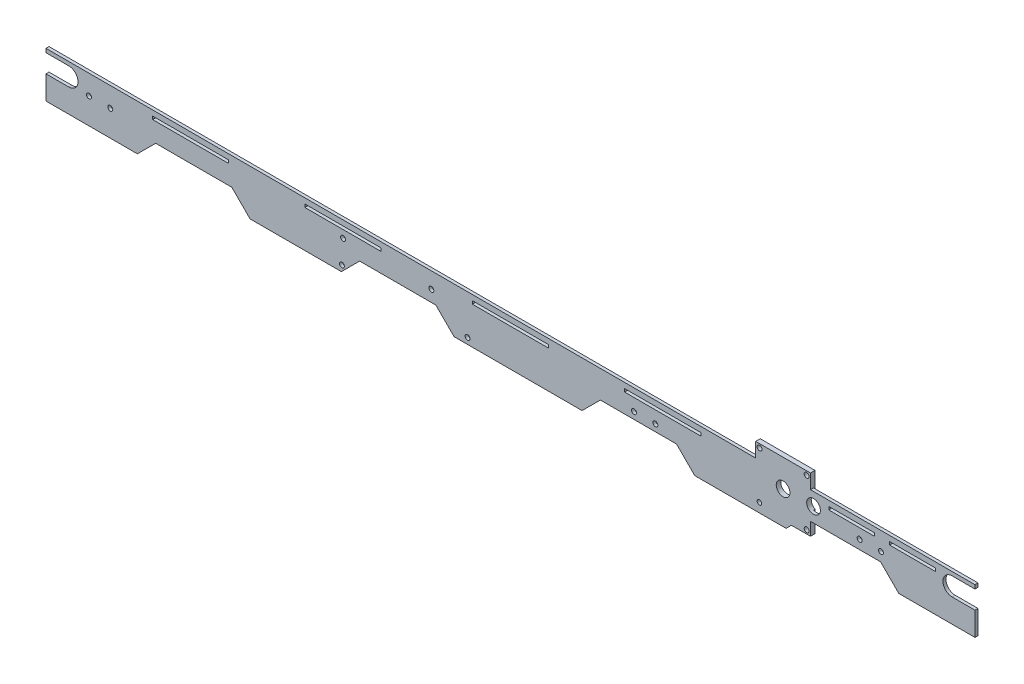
ISO-10303-21;
HEADER;
FILE_DESCRIPTION(('STEP AP214'),'2;1');
FILE_NAME('part.step','',(''),(''),'','','');
FILE_SCHEMA(('AUTOMOTIVE_DESIGN { 1 0 10303 214 1 1 1 1 }'));
ENDSEC;
DATA;
#1=APPLICATION_CONTEXT('core data for automotive mechanical design processes');
#2=APPLICATION_PROTOCOL_DEFINITION('international standard','automotive_design',2000,#1);
#3=PRODUCT_CONTEXT('',#1,'mechanical');
#4=PRODUCT('Part','Part','',(#3));
#5=PRODUCT_RELATED_PRODUCT_CATEGORY('part','',(#4));
#6=PRODUCT_DEFINITION_FORMATION('','',#4);
#7=PRODUCT_DEFINITION_CONTEXT('part definition',#1,'design');
#8=PRODUCT_DEFINITION('design','',#6,#7);
#9=PRODUCT_DEFINITION_SHAPE('','',#8);
#10=(LENGTH_UNIT() NAMED_UNIT(*) SI_UNIT(.MILLI.,.METRE.));
#11=(NAMED_UNIT(*) PLANE_ANGLE_UNIT() SI_UNIT($,.RADIAN.));
#12=(NAMED_UNIT(*) SI_UNIT($,.STERADIAN.) SOLID_ANGLE_UNIT());
#13=UNCERTAINTY_MEASURE_WITH_UNIT(LENGTH_MEASURE(1.E-05),#10,'distance_accuracy_value','');
#14=(GEOMETRIC_REPRESENTATION_CONTEXT(3) GLOBAL_UNCERTAINTY_ASSIGNED_CONTEXT((#13)) GLOBAL_UNIT_ASSIGNED_CONTEXT((#10,
#11,#12)) REPRESENTATION_CONTEXT('',''));
#15=CARTESIAN_POINT('',(0.,0.,0.));
#16=DIRECTION('',(0.,0.,1.));
#17=DIRECTION('',(1.,0.,0.));
#18=AXIS2_PLACEMENT_3D('',#15,#16,#17);
#19=CARTESIAN_POINT('',(192.,-23.4999999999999,-1.));
#20=DIRECTION('',(1.,0.,0.));
#21=DIRECTION('',(0.,0.,-1.));
#22=AXIS2_PLACEMENT_3D('',#19,#20,#21);
#23=PLANE('',#22);
#24=DIRECTION('',(0.,0.,1.));
#25=VECTOR('',#24,1.);
#26=CARTESIAN_POINT('',(192.,-1.46887112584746,-1.));
#27=LINE('',#26,#25);
#28=CARTESIAN_POINT('',(192.,-1.46887112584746,-1.));
#29=VERTEX_POINT('',#28);
#30=CARTESIAN_POINT('',(192.,-1.46887112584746,0.));
#31=VERTEX_POINT('',#30);
#32=EDGE_CURVE('E485',#29,#31,#27,.T.);
#33=ORIENTED_EDGE('',*,*,#32,.F.);
#34=DIRECTION('',(0.,1.,0.));
#35=VECTOR('',#34,1.);
#36=CARTESIAN_POINT('',(192.,-23.4999999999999,-1.));
#37=LINE('',#36,#35);
#38=CARTESIAN_POINT('',(192.,12.5000000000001,-1.));
#39=VERTEX_POINT('',#38);
#40=EDGE_CURVE('E617',#29,#39,#37,.T.);
#41=ORIENTED_EDGE('',*,*,#40,.T.);
#42=DIRECTION('',(0.,0.,1.));
#43=VECTOR('',#42,1.);
#44=CARTESIAN_POINT('',(192.,12.5000000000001,-1.));
#45=LINE('',#44,#43);
#46=CARTESIAN_POINT('',(192.,12.5000000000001,2.));
#47=VERTEX_POINT('',#46);
#48=EDGE_CURVE('E626',#39,#47,#45,.T.);
#49=ORIENTED_EDGE('',*,*,#48,.T.);
#50=DIRECTION('',(0.,1.,0.));
#51=VECTOR('',#50,1.);
#52=CARTESIAN_POINT('',(192.,-23.4999999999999,2.));
#53=LINE('',#52,#51);
#54=CARTESIAN_POINT('',(192.,3.00000000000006,2.));
#55=VERTEX_POINT('',#54);
#56=EDGE_CURVE('E612',#55,#47,#53,.T.);
#57=ORIENTED_EDGE('',*,*,#56,.F.);
#58=DIRECTION('',(0.,0.,1.));
#59=VECTOR('',#58,1.);
#60=CARTESIAN_POINT('',(192.,3.00000000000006,2.));
#61=LINE('',#60,#59);
#62=CARTESIAN_POINT('',(192.,3.00000000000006,0.));
#63=VERTEX_POINT('',#62);
#64=EDGE_CURVE('E657',#63,#55,#61,.T.);
#65=ORIENTED_EDGE('',*,*,#64,.F.);
#66=DIRECTION('',(0.,-1.,0.));
#67=VECTOR('',#66,1.);
#68=CARTESIAN_POINT('',(192.,0.,0.));
#69=LINE('',#68,#67);
#70=EDGE_CURVE('E924',#63,#31,#69,.T.);
#71=ORIENTED_EDGE('',*,*,#70,.T.);
#72=EDGE_LOOP('',(#33,#41,#49,#57,#65,#71));
#73=FACE_BOUND('',#72,.T.);
#74=ADVANCED_FACE('F39',(#73),#23,.T.);
#75=CARTESIAN_POINT('',(300.,3.00000000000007,2.));
#76=DIRECTION('',(-1.,0.,0.));
#77=DIRECTION('',(0.,0.,1.));
#78=AXIS2_PLACEMENT_3D('',#75,#76,#77);
#79=PLANE('',#78);
#80=DIRECTION('',(0.,1.,0.));
#81=VECTOR('',#80,1.);
#82=CARTESIAN_POINT('',(300.,3.00000000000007,2.));
#83=LINE('',#82,#81);
#84=CARTESIAN_POINT('',(300.,0.500000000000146,2.));
#85=VERTEX_POINT('',#84);
#86=CARTESIAN_POINT('',(300.,3.00000000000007,2.));
#87=VERTEX_POINT('',#86);
#88=EDGE_CURVE('E747',#85,#87,#83,.T.);
#89=ORIENTED_EDGE('',*,*,#88,.F.);
#90=DIRECTION('',(0.,0.,1.));
#91=VECTOR('',#90,1.);
#92=CARTESIAN_POINT('',(300.,0.500000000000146,-1.));
#93=LINE('',#92,#91);
#94=CARTESIAN_POINT('',(300.,0.500000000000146,0.));
#95=VERTEX_POINT('',#94);
#96=EDGE_CURVE('E509',#95,#85,#93,.T.);
#97=ORIENTED_EDGE('',*,*,#96,.F.);
#98=DIRECTION('',(0.,1.,0.));
#99=VECTOR('',#98,1.);
#100=CARTESIAN_POINT('',(300.,3.00000000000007,0.));
#101=LINE('',#100,#99);
#102=CARTESIAN_POINT('',(300.,3.00000000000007,0.));
#103=VERTEX_POINT('',#102);
#104=EDGE_CURVE('E678',#95,#103,#101,.T.);
#105=ORIENTED_EDGE('',*,*,#104,.T.);
#106=DIRECTION('',(0.,0.,-1.));
#107=VECTOR('',#106,1.);
#108=CARTESIAN_POINT('',(300.,3.00000000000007,2.));
#109=LINE('',#108,#107);
#110=EDGE_CURVE('E876',#87,#103,#109,.T.);
#111=ORIENTED_EDGE('',*,*,#110,.F.);
#112=EDGE_LOOP('',(#89,#97,#105,#111));
#113=FACE_BOUND('',#112,.T.);
#114=ADVANCED_FACE('F1047',(#113),#79,.F.);
#115=CARTESIAN_POINT('',(-310.,3.,0.));
#116=DIRECTION('',(-1.,0.,0.));
#117=DIRECTION('',(0.,0.,1.));
#118=AXIS2_PLACEMENT_3D('',#115,#116,#117);
#119=PLANE('',#118);
#120=DIRECTION('',(0.,0.,1.));
#121=VECTOR('',#120,1.);
#122=CARTESIAN_POINT('',(-310.,-11.4999999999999,0.));
#123=LINE('',#122,#121);
#124=CARTESIAN_POINT('',(-310.,-11.4999999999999,0.));
#125=VERTEX_POINT('',#124);
#126=CARTESIAN_POINT('',(-310.,-11.4999999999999,2.));
#127=VERTEX_POINT('',#126);
#128=EDGE_CURVE('E935',#125,#127,#123,.T.);
#129=ORIENTED_EDGE('',*,*,#128,.F.);
#130=DIRECTION('',(0.,-1.,0.));
#131=VECTOR('',#130,1.);
#132=CARTESIAN_POINT('',(-310.,3.,0.));
#133=LINE('',#132,#131);
#134=CARTESIAN_POINT('',(-310.,-27.,0.));
#135=VERTEX_POINT('',#134);
#136=EDGE_CURVE('E575',#125,#135,#133,.T.);
#137=ORIENTED_EDGE('',*,*,#136,.T.);
#138=DIRECTION('',(0.,0.,1.));
#139=VECTOR('',#138,1.);
#140=CARTESIAN_POINT('',(-310.,-27.,0.));
#141=LINE('',#140,#139);
#142=CARTESIAN_POINT('',(-310.,-27.,2.));
#143=VERTEX_POINT('',#142);
#144=EDGE_CURVE('E579',#135,#143,#141,.T.);
#145=ORIENTED_EDGE('',*,*,#144,.T.);
#146=DIRECTION('',(0.,-1.,0.));
#147=VECTOR('',#146,1.);
#148=CARTESIAN_POINT('',(-310.,3.,2.));
#149=LINE('',#148,#147);
#150=EDGE_CURVE('E570',#127,#143,#149,.T.);
#151=ORIENTED_EDGE('',*,*,#150,.F.);
#152=EDGE_LOOP('',(#129,#137,#145,#151));
#153=FACE_BOUND('',#152,.T.);
#154=ADVANCED_FACE('F1056',(#153),#119,.T.);
#155=CARTESIAN_POINT('',(-300.,3.,2.));
#156=DIRECTION('',(0.,-1.,0.));
#157=DIRECTION('',(1.,0.,0.));
#158=AXIS2_PLACEMENT_3D('',#155,#156,#157);
#159=PLANE('',#158);
#160=DIRECTION('',(-1.,0.,0.));
#161=VECTOR('',#160,1.);
#162=CARTESIAN_POINT('',(-300.,3.,0.));
#163=LINE('',#162,#161);
#164=EDGE_CURVE('E791',#103,#63,#163,.T.);
#165=ORIENTED_EDGE('',*,*,#164,.T.);
#166=ORIENTED_EDGE('',*,*,#64,.T.);
#167=DIRECTION('',(-1.,0.,0.));
#168=VECTOR('',#167,1.);
#169=CARTESIAN_POINT('',(-300.,3.,2.));
#170=LINE('',#169,#168);
#171=EDGE_CURVE('E748',#87,#55,#170,.T.);
#172=ORIENTED_EDGE('',*,*,#171,.F.);
#173=ORIENTED_EDGE('',*,*,#110,.T.);
#174=EDGE_LOOP('',(#165,#166,#172,#173));
#175=FACE_BOUND('',#174,.T.);
#176=ADVANCED_FACE('F1267',(#175),#159,.F.);
#177=CARTESIAN_POINT('',(0.,0.,0.));
#178=DIRECTION('',(0.,0.,-1.));
#179=DIRECTION('',(-1.,0.,0.));
#180=AXIS2_PLACEMENT_3D('',#177,#178,#179);
#181=PLANE('',#180);
#182=DIRECTION('',(0.,-1.,0.));
#183=VECTOR('',#182,1.);
#184=CARTESIAN_POINT('',(274.,-0.499999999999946,0.));
#185=LINE('',#184,#183);
#186=CARTESIAN_POINT('',(274.,-0.499999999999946,0.));
#187=VERTEX_POINT('',#186);
#188=CARTESIAN_POINT('',(274.,-2.49999999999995,0.));
#189=VERTEX_POINT('',#188);
#190=EDGE_CURVE('E56',#187,#189,#185,.T.);
#191=ORIENTED_EDGE('',*,*,#190,.F.);
#192=DIRECTION('',(1.,0.,0.));
#193=VECTOR('',#192,1.);
#194=CARTESIAN_POINT('',(274.,-0.499999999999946,0.));
#195=LINE('',#194,#193);
#196=CARTESIAN_POINT('',(244.,-0.499999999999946,0.));
#197=VERTEX_POINT('',#196);
#198=EDGE_CURVE('E448',#197,#187,#195,.T.);
#199=ORIENTED_EDGE('',*,*,#198,.F.);
#200=DIRECTION('',(0.,1.,0.));
#201=VECTOR('',#200,1.);
#202=CARTESIAN_POINT('',(244.,-0.499999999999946,0.));
#203=LINE('',#202,#201);
#204=CARTESIAN_POINT('',(244.,-2.49999999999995,0.));
#205=VERTEX_POINT('',#204);
#206=EDGE_CURVE('E431',#205,#197,#203,.T.);
#207=ORIENTED_EDGE('',*,*,#206,.F.);
#208=DIRECTION('',(-1.,0.,0.));
#209=VECTOR('',#208,1.);
#210=CARTESIAN_POINT('',(274.,-2.49999999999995,0.));
#211=LINE('',#210,#209);
#212=EDGE_CURVE('E441',#189,#205,#211,.T.);
#213=ORIENTED_EDGE('',*,*,#212,.F.);
#214=EDGE_LOOP('',(#191,#199,#207,#213));
#215=FACE_BOUND('',#214,.T.);
#216=DIRECTION('',(0.,-1.,0.));
#217=VECTOR('',#216,1.);
#218=CARTESIAN_POINT('',(234.,-0.499999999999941,0.));
#219=LINE('',#218,#217);
#220=CARTESIAN_POINT('',(234.,-0.499999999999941,0.));
#221=VERTEX_POINT('',#220);
#222=CARTESIAN_POINT('',(234.,-2.49999999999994,0.));
#223=VERTEX_POINT('',#222);
#224=EDGE_CURVE('E64',#221,#223,#219,.T.);
#225=ORIENTED_EDGE('',*,*,#224,.F.);
#226=DIRECTION('',(1.,0.,0.));
#227=VECTOR('',#226,1.);
#228=CARTESIAN_POINT('',(234.,-0.499999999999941,0.));
#229=LINE('',#228,#227);
#230=CARTESIAN_POINT('',(204.,-0.499999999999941,0.));
#231=VERTEX_POINT('',#230);
#232=EDGE_CURVE('E460',#231,#221,#229,.T.);
#233=ORIENTED_EDGE('',*,*,#232,.F.);
#234=DIRECTION('',(0.,1.,0.));
#235=VECTOR('',#234,1.);
#236=CARTESIAN_POINT('',(204.,-0.499999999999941,0.));
#237=LINE('',#236,#235);
#238=CARTESIAN_POINT('',(204.,-2.49999999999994,0.));
#239=VERTEX_POINT('',#238);
#240=EDGE_CURVE('E469',#239,#231,#237,.T.);
#241=ORIENTED_EDGE('',*,*,#240,.F.);
#242=DIRECTION('',(-1.,0.,0.));
#243=VECTOR('',#242,1.);
#244=CARTESIAN_POINT('',(234.,-2.49999999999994,0.));
#245=LINE('',#244,#243);
#246=EDGE_CURVE('E472',#223,#239,#245,.T.);
#247=ORIENTED_EDGE('',*,*,#246,.F.);
#248=EDGE_LOOP('',(#225,#233,#241,#247));
#249=FACE_BOUND('',#248,.T.);
#250=CARTESIAN_POINT('',(194.,-5.49999999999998,0.));
#251=DIRECTION('',(0.,0.,-1.));
#252=DIRECTION('',(-1.,0.,0.));
#253=AXIS2_PLACEMENT_3D('',#250,#251,#252);
#254=CIRCLE('',#253,4.50000000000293);
#255=CARTESIAN_POINT('',(192.,-9.5311288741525,0.));
#256=VERTEX_POINT('',#255);
#257=EDGE_CURVE('E483',#31,#256,#254,.T.);
#258=ORIENTED_EDGE('',*,*,#257,.F.);
#259=ORIENTED_EDGE('',*,*,#70,.F.);
#260=ORIENTED_EDGE('',*,*,#164,.F.);
#261=ORIENTED_EDGE('',*,*,#104,.F.);
#262=DIRECTION('',(1.,0.,0.));
#263=VECTOR('',#262,1.);
#264=CARTESIAN_POINT('',(0.,0.500000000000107,0.));
#265=LINE('',#264,#263);
#266=CARTESIAN_POINT('',(285.,0.500000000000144,0.));
#267=VERTEX_POINT('',#266);
#268=EDGE_CURVE('E522',#267,#95,#265,.T.);
#269=ORIENTED_EDGE('',*,*,#268,.F.);
#270=CARTESIAN_POINT('',(285.,-5.49999999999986,0.));
#271=DIRECTION('',(0.,0.,-1.));
#272=DIRECTION('',(-1.,0.,0.));
#273=AXIS2_PLACEMENT_3D('',#270,#271,#272);
#274=CIRCLE('',#273,6.);
#275=CARTESIAN_POINT('',(285.,-11.4999999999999,0.));
#276=VERTEX_POINT('',#275);
#277=EDGE_CURVE('E524',#276,#267,#274,.T.);
#278=ORIENTED_EDGE('',*,*,#277,.F.);
#279=DIRECTION('',(-1.,0.,0.));
#280=VECTOR('',#279,1.);
#281=CARTESIAN_POINT('',(0.,-11.4999999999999,0.));
#282=LINE('',#281,#280);
#283=CARTESIAN_POINT('',(300.,-11.4999999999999,0.));
#284=VERTEX_POINT('',#283);
#285=EDGE_CURVE('E520',#284,#276,#282,.T.);
#286=ORIENTED_EDGE('',*,*,#285,.F.);
#287=CARTESIAN_POINT('',(300.,-27.,0.));
#288=VERTEX_POINT('',#287);
#289=EDGE_CURVE('E787',#288,#284,#101,.T.);
#290=ORIENTED_EDGE('',*,*,#289,.F.);
#291=DIRECTION('',(1.,0.,0.));
#292=VECTOR('',#291,1.);
#293=CARTESIAN_POINT('',(300.,-27.,0.));
#294=LINE('',#293,#292);
#295=CARTESIAN_POINT('',(250.,-27.,0.));
#296=VERTEX_POINT('',#295);
#297=EDGE_CURVE('E827',#296,#288,#294,.T.);
#298=ORIENTED_EDGE('',*,*,#297,.F.);
#299=DIRECTION('',(0.707106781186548,-0.707106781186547,0.));
#300=VECTOR('',#299,1.);
#301=CARTESIAN_POINT('',(250.,-27.,0.));
#302=LINE('',#301,#300);
#303=CARTESIAN_POINT('',(238.,-15.,0.));
#304=VERTEX_POINT('',#303);
#305=EDGE_CURVE('E825',#304,#296,#302,.T.);
#306=ORIENTED_EDGE('',*,*,#305,.F.);
#307=DIRECTION('',(1.,0.,0.));
#308=VECTOR('',#307,1.);
#309=CARTESIAN_POINT('',(238.,-15.,0.));
#310=LINE('',#309,#308);
#311=CARTESIAN_POINT('',(192.,-15.,0.));
#312=VERTEX_POINT('',#311);
#313=EDGE_CURVE('E823',#312,#304,#310,.T.);
#314=ORIENTED_EDGE('',*,*,#313,.F.);
#315=EDGE_CURVE('E923',#256,#312,#69,.T.);
#316=ORIENTED_EDGE('',*,*,#315,.F.);
#317=EDGE_LOOP('',(#258,#259,#260,#261,#269,#278,#286,#290,#298,#306,#314,#316));
#318=FACE_BOUND('',#317,.T.);
#319=CARTESIAN_POINT('',(224.273370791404,-8.99999999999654,0.));
#320=DIRECTION('',(0.,0.,-1.));
#321=DIRECTION('',(-1.,0.,0.));
#322=AXIS2_PLACEMENT_3D('',#319,#320,#321);
#323=CIRCLE('',#322,1.62499999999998);
#324=CARTESIAN_POINT('',(222.648370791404,-8.99999999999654,0.));
#325=VERTEX_POINT('',#324);
#326=EDGE_CURVE('E543',#325,#325,#323,.T.);
#327=ORIENTED_EDGE('',*,*,#326,.F.);
#328=EDGE_LOOP('',(#327));
#329=FACE_BOUND('',#328,.T.);
#330=CARTESIAN_POINT('',(238.273370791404,-8.99999999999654,0.));
#331=DIRECTION('',(0.,0.,-1.));
#332=DIRECTION('',(-1.,0.,0.));
#333=AXIS2_PLACEMENT_3D('',#330,#331,#332);
#334=CIRCLE('',#333,1.62499999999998);
#335=CARTESIAN_POINT('',(236.648370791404,-8.99999999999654,0.));
#336=VERTEX_POINT('',#335);
#337=EDGE_CURVE('E536',#336,#336,#334,.T.);
#338=ORIENTED_EDGE('',*,*,#337,.F.);
#339=EDGE_LOOP('',(#338));
#340=FACE_BOUND('',#339,.T.);
#341=ADVANCED_FACE('F445',(#215,#249,#318,#329,#340),#181,.T.);
#342=ORIENTED_EDGE('',*,*,#289,.T.);
#343=DIRECTION('',(0.,0.,1.));
#344=VECTOR('',#343,1.);
#345=CARTESIAN_POINT('',(300.,-11.4999999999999,-1.));
#346=LINE('',#345,#344);
#347=CARTESIAN_POINT('',(300.,-11.4999999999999,2.));
#348=VERTEX_POINT('',#347);
#349=EDGE_CURVE('E506',#284,#348,#346,.T.);
#350=ORIENTED_EDGE('',*,*,#349,.T.);
#351=CARTESIAN_POINT('',(300.,-27.,2.));
#352=VERTEX_POINT('',#351);
#353=EDGE_CURVE('E743',#352,#348,#83,.T.);
#354=ORIENTED_EDGE('',*,*,#353,.F.);
#355=DIRECTION('',(0.,0.,-1.));
#356=VECTOR('',#355,1.);
#357=CARTESIAN_POINT('',(300.,-27.,2.));
#358=LINE('',#357,#356);
#359=EDGE_CURVE('E786',#352,#288,#358,.T.);
#360=ORIENTED_EDGE('',*,*,#359,.T.);
#361=EDGE_LOOP('',(#342,#350,#354,#360));
#362=FACE_BOUND('',#361,.T.);
#363=ADVANCED_FACE('F41',(#362),#79,.F.);
#364=CARTESIAN_POINT('',(156.,3.00000000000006,2.));
#365=VERTEX_POINT('',#364);
#366=CARTESIAN_POINT('',(-310.,3.,2.));
#367=VERTEX_POINT('',#366);
#368=EDGE_CURVE('E746',#365,#367,#170,.T.);
#369=ORIENTED_EDGE('',*,*,#368,.F.);
#370=DIRECTION('',(0.,0.,-1.));
#371=VECTOR('',#370,1.);
#372=CARTESIAN_POINT('',(156.,3.00000000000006,2.));
#373=LINE('',#372,#371);
#374=CARTESIAN_POINT('',(156.,3.00000000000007,0.));
#375=VERTEX_POINT('',#374);
#376=EDGE_CURVE('E649',#365,#375,#373,.T.);
#377=ORIENTED_EDGE('',*,*,#376,.T.);
#378=CARTESIAN_POINT('',(-310.,3.,0.));
#379=VERTEX_POINT('',#378);
#380=EDGE_CURVE('E790',#375,#379,#163,.T.);
#381=ORIENTED_EDGE('',*,*,#380,.T.);
#382=DIRECTION('',(0.,0.,1.));
#383=VECTOR('',#382,1.);
#384=CARTESIAN_POINT('',(-310.,3.,0.));
#385=LINE('',#384,#383);
#386=EDGE_CURVE('E574',#379,#367,#385,.T.);
#387=ORIENTED_EDGE('',*,*,#386,.T.);
#388=EDGE_LOOP('',(#369,#377,#381,#387));
#389=FACE_BOUND('',#388,.T.);
#390=ADVANCED_FACE('F1260',(#389),#159,.F.);
#391=CARTESIAN_POINT('',(-300.,-27.0000000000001,2.));
#392=DIRECTION('',(0.,1.,0.));
#393=DIRECTION('',(0.,0.,1.));
#394=AXIS2_PLACEMENT_3D('',#391,#392,#393);
#395=PLANE('',#394);
#396=DIRECTION('',(1.,0.,0.));
#397=VECTOR('',#396,1.);
#398=CARTESIAN_POINT('',(-300.,-27.0000000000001,0.));
#399=LINE('',#398,#397);
#400=CARTESIAN_POINT('',(-250.,-27.0000000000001,0.));
#401=VERTEX_POINT('',#400);
#402=EDGE_CURVE('E794',#135,#401,#399,.T.);
#403=ORIENTED_EDGE('',*,*,#402,.T.);
#404=DIRECTION('',(0.,0.,-1.));
#405=VECTOR('',#404,1.);
#406=CARTESIAN_POINT('',(-250.,-27.0000000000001,2.));
#407=LINE('',#406,#405);
#408=CARTESIAN_POINT('',(-250.,-27.0000000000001,2.));
#409=VERTEX_POINT('',#408);
#410=EDGE_CURVE('E873',#409,#401,#407,.T.);
#411=ORIENTED_EDGE('',*,*,#410,.F.);
#412=DIRECTION('',(1.,0.,0.));
#413=VECTOR('',#412,1.);
#414=CARTESIAN_POINT('',(-300.,-27.0000000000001,2.));
#415=LINE('',#414,#413);
#416=EDGE_CURVE('E751',#143,#409,#415,.T.);
#417=ORIENTED_EDGE('',*,*,#416,.F.);
#418=ORIENTED_EDGE('',*,*,#144,.F.);
#419=EDGE_LOOP('',(#403,#411,#417,#418));
#420=FACE_BOUND('',#419,.T.);
#421=ADVANCED_FACE('F1265',(#420),#395,.F.);
#422=CARTESIAN_POINT('',(-250.,-27.0000000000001,2.));
#423=DIRECTION('',(-0.707106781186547,0.707106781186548,0.));
#424=DIRECTION('',(-0.707106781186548,-0.707106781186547,0.));
#425=AXIS2_PLACEMENT_3D('',#422,#423,#424);
#426=PLANE('',#425);
#427=DIRECTION('',(0.707106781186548,0.707106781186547,0.));
#428=VECTOR('',#427,1.);
#429=CARTESIAN_POINT('',(-250.,-27.0000000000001,0.));
#430=LINE('',#429,#428);
#431=CARTESIAN_POINT('',(-238.,-15.0000000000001,0.));
#432=VERTEX_POINT('',#431);
#433=EDGE_CURVE('E796',#401,#432,#430,.T.);
#434=ORIENTED_EDGE('',*,*,#433,.T.);
#435=DIRECTION('',(0.,0.,-1.));
#436=VECTOR('',#435,1.);
#437=CARTESIAN_POINT('',(-238.,-15.0000000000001,2.));
#438=LINE('',#437,#436);
#439=CARTESIAN_POINT('',(-238.,-15.0000000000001,2.));
#440=VERTEX_POINT('',#439);
#441=EDGE_CURVE('E870',#440,#432,#438,.T.);
#442=ORIENTED_EDGE('',*,*,#441,.F.);
#443=DIRECTION('',(0.707106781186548,0.707106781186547,0.));
#444=VECTOR('',#443,1.);
#445=CARTESIAN_POINT('',(-250.,-27.0000000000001,2.));
#446=LINE('',#445,#444);
#447=EDGE_CURVE('E753',#409,#440,#446,.T.);
#448=ORIENTED_EDGE('',*,*,#447,.F.);
#449=ORIENTED_EDGE('',*,*,#410,.T.);
#450=EDGE_LOOP('',(#434,#442,#448,#449));
#451=FACE_BOUND('',#450,.T.);
#452=ADVANCED_FACE('F1278',(#451),#426,.F.);
#453=CARTESIAN_POINT('',(-238.,-15.0000000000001,2.));
#454=DIRECTION('',(0.,1.,0.));
#455=DIRECTION('',(-1.,0.,0.));
#456=AXIS2_PLACEMENT_3D('',#453,#454,#455);
#457=PLANE('',#456);
#458=DIRECTION('',(1.,0.,0.));
#459=VECTOR('',#458,1.);
#460=CARTESIAN_POINT('',(-238.,-15.0000000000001,0.));
#461=LINE('',#460,#459);
#462=CARTESIAN_POINT('',(-188.,-15.0000000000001,0.));
#463=VERTEX_POINT('',#462);
#464=EDGE_CURVE('E798',#432,#463,#461,.T.);
#465=ORIENTED_EDGE('',*,*,#464,.T.);
#466=DIRECTION('',(0.,0.,-1.));
#467=VECTOR('',#466,1.);
#468=CARTESIAN_POINT('',(-188.,-15.0000000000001,2.));
#469=LINE('',#468,#467);
#470=CARTESIAN_POINT('',(-188.,-15.0000000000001,2.));
#471=VERTEX_POINT('',#470);
#472=EDGE_CURVE('E867',#471,#463,#469,.T.);
#473=ORIENTED_EDGE('',*,*,#472,.F.);
#474=DIRECTION('',(1.,0.,0.));
#475=VECTOR('',#474,1.);
#476=CARTESIAN_POINT('',(-238.,-15.0000000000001,2.));
#477=LINE('',#476,#475);
#478=EDGE_CURVE('E755',#440,#471,#477,.T.);
#479=ORIENTED_EDGE('',*,*,#478,.F.);
#480=ORIENTED_EDGE('',*,*,#441,.T.);
#481=EDGE_LOOP('',(#465,#473,#479,#480));
#482=FACE_BOUND('',#481,.T.);
#483=ADVANCED_FACE('F1610',(#482),#457,.F.);
#484=CARTESIAN_POINT('',(-188.,-15.0000000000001,2.));
#485=DIRECTION('',(0.707106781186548,0.707106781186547,0.));
#486=DIRECTION('',(-0.707106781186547,0.707106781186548,0.));
#487=AXIS2_PLACEMENT_3D('',#484,#485,#486);
#488=PLANE('',#487);
#489=DIRECTION('',(0.707106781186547,-0.707106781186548,0.));
#490=VECTOR('',#489,1.);
#491=CARTESIAN_POINT('',(-188.,-15.0000000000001,0.));
#492=LINE('',#491,#490);
#493=CARTESIAN_POINT('',(-176.,-27.,0.));
#494=VERTEX_POINT('',#493);
#495=EDGE_CURVE('E800',#463,#494,#492,.T.);
#496=ORIENTED_EDGE('',*,*,#495,.T.);
#497=DIRECTION('',(0.,0.,-1.));
#498=VECTOR('',#497,1.);
#499=CARTESIAN_POINT('',(-176.,-27.,2.));
#500=LINE('',#499,#498);
#501=CARTESIAN_POINT('',(-176.,-27.,2.));
#502=VERTEX_POINT('',#501);
#503=EDGE_CURVE('E864',#502,#494,#500,.T.);
#504=ORIENTED_EDGE('',*,*,#503,.F.);
#505=DIRECTION('',(0.707106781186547,-0.707106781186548,0.));
#506=VECTOR('',#505,1.);
#507=CARTESIAN_POINT('',(-188.,-15.0000000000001,2.));
#508=LINE('',#507,#506);
#509=EDGE_CURVE('E757',#471,#502,#508,.T.);
#510=ORIENTED_EDGE('',*,*,#509,.F.);
#511=ORIENTED_EDGE('',*,*,#472,.T.);
#512=EDGE_LOOP('',(#496,#504,#510,#511));
#513=FACE_BOUND('',#512,.T.);
#514=ADVANCED_FACE('F1606',(#513),#488,.F.);
#515=CARTESIAN_POINT('',(-116.02,-27.,2.));
#516=DIRECTION('',(0.,1.,0.));
#517=DIRECTION('',(-1.,0.,0.));
#518=AXIS2_PLACEMENT_3D('',#515,#516,#517);
#519=PLANE('',#518);
#520=DIRECTION('',(1.,0.,0.));
#521=VECTOR('',#520,1.);
#522=CARTESIAN_POINT('',(-116.02,-27.,0.));
#523=LINE('',#522,#521);
#524=CARTESIAN_POINT('',(-116.02,-27.,0.));
#525=VERTEX_POINT('',#524);
#526=EDGE_CURVE('E802',#494,#525,#523,.T.);
#527=ORIENTED_EDGE('',*,*,#526,.T.);
#528=DIRECTION('',(0.,0.,-1.));
#529=VECTOR('',#528,1.);
#530=CARTESIAN_POINT('',(-116.02,-27.,2.));
#531=LINE('',#530,#529);
#532=CARTESIAN_POINT('',(-116.02,-27.,2.));
#533=VERTEX_POINT('',#532);
#534=EDGE_CURVE('E861',#533,#525,#531,.T.);
#535=ORIENTED_EDGE('',*,*,#534,.F.);
#536=DIRECTION('',(1.,0.,0.));
#537=VECTOR('',#536,1.);
#538=CARTESIAN_POINT('',(-116.02,-27.,2.));
#539=LINE('',#538,#537);
#540=EDGE_CURVE('E759',#502,#533,#539,.T.);
#541=ORIENTED_EDGE('',*,*,#540,.F.);
#542=ORIENTED_EDGE('',*,*,#503,.T.);
#543=EDGE_LOOP('',(#527,#535,#541,#542));
#544=FACE_BOUND('',#543,.T.);
#545=ADVANCED_FACE('F1602',(#544),#519,.F.);
#546=CARTESIAN_POINT('',(-116.02,-27.,2.));
#547=DIRECTION('',(-0.707106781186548,0.707106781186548,0.));
#548=DIRECTION('',(-0.707106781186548,-0.707106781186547,0.));
#549=AXIS2_PLACEMENT_3D('',#546,#547,#548);
#550=PLANE('',#549);
#551=DIRECTION('',(0.707106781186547,0.707106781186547,0.));
#552=VECTOR('',#551,1.);
#553=CARTESIAN_POINT('',(-116.02,-27.,0.));
#554=LINE('',#553,#552);
#555=CARTESIAN_POINT('',(-104.02,-15.,0.));
#556=VERTEX_POINT('',#555);
#557=EDGE_CURVE('E804',#525,#556,#554,.T.);
#558=ORIENTED_EDGE('',*,*,#557,.T.);
#559=DIRECTION('',(0.,0.,-1.));
#560=VECTOR('',#559,1.);
#561=CARTESIAN_POINT('',(-104.02,-15.,2.));
#562=LINE('',#561,#560);
#563=CARTESIAN_POINT('',(-104.02,-15.,2.));
#564=VERTEX_POINT('',#563);
#565=EDGE_CURVE('E858',#564,#556,#562,.T.);
#566=ORIENTED_EDGE('',*,*,#565,.F.);
#567=DIRECTION('',(0.707106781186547,0.707106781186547,0.));
#568=VECTOR('',#567,1.);
#569=CARTESIAN_POINT('',(-116.02,-27.,2.));
#570=LINE('',#569,#568);
#571=EDGE_CURVE('E761',#533,#564,#570,.T.);
#572=ORIENTED_EDGE('',*,*,#571,.F.);
#573=ORIENTED_EDGE('',*,*,#534,.T.);
#574=EDGE_LOOP('',(#558,#566,#572,#573));
#575=FACE_BOUND('',#574,.T.);
#576=ADVANCED_FACE('F1598',(#575),#550,.F.);
#577=CARTESIAN_POINT('',(-104.02,-15.,2.));
#578=DIRECTION('',(0.,1.,0.));
#579=DIRECTION('',(-1.,0.,0.));
#580=AXIS2_PLACEMENT_3D('',#577,#578,#579);
#581=PLANE('',#580);
#582=DIRECTION('',(1.,0.,0.));
#583=VECTOR('',#582,1.);
#584=CARTESIAN_POINT('',(-104.02,-15.,0.));
#585=LINE('',#584,#583);
#586=CARTESIAN_POINT('',(-54.02,-15.,0.));
#587=VERTEX_POINT('',#586);
#588=EDGE_CURVE('E806',#556,#587,#585,.T.);
#589=ORIENTED_EDGE('',*,*,#588,.T.);
#590=DIRECTION('',(0.,0.,-1.));
#591=VECTOR('',#590,1.);
#592=CARTESIAN_POINT('',(-54.02,-15.,2.));
#593=LINE('',#592,#591);
#594=CARTESIAN_POINT('',(-54.02,-15.,2.));
#595=VERTEX_POINT('',#594);
#596=EDGE_CURVE('E855',#595,#587,#593,.T.);
#597=ORIENTED_EDGE('',*,*,#596,.F.);
#598=DIRECTION('',(1.,0.,0.));
#599=VECTOR('',#598,1.);
#600=CARTESIAN_POINT('',(-104.02,-15.,2.));
#601=LINE('',#600,#599);
#602=EDGE_CURVE('E763',#564,#595,#601,.T.);
#603=ORIENTED_EDGE('',*,*,#602,.F.);
#604=ORIENTED_EDGE('',*,*,#565,.T.);
#605=EDGE_LOOP('',(#589,#597,#603,#604));
#606=FACE_BOUND('',#605,.T.);
#607=ADVANCED_FACE('F1594',(#606),#581,.F.);
#608=CARTESIAN_POINT('',(-54.02,-15.,2.));
#609=DIRECTION('',(0.707106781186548,0.707106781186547,0.));
#610=DIRECTION('',(-0.707106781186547,0.707106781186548,0.));
#611=AXIS2_PLACEMENT_3D('',#608,#609,#610);
#612=PLANE('',#611);
#613=DIRECTION('',(0.707106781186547,-0.707106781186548,0.));
#614=VECTOR('',#613,1.);
#615=CARTESIAN_POINT('',(-54.02,-15.,0.));
#616=LINE('',#615,#614);
#617=CARTESIAN_POINT('',(-42.02,-27.,0.));
#618=VERTEX_POINT('',#617);
#619=EDGE_CURVE('E808',#587,#618,#616,.T.);
#620=ORIENTED_EDGE('',*,*,#619,.T.);
#621=DIRECTION('',(0.,0.,-1.));
#622=VECTOR('',#621,1.);
#623=CARTESIAN_POINT('',(-42.02,-27.,2.));
#624=LINE('',#623,#622);
#625=CARTESIAN_POINT('',(-42.02,-27.,2.));
#626=VERTEX_POINT('',#625);
#627=EDGE_CURVE('E852',#626,#618,#624,.T.);
#628=ORIENTED_EDGE('',*,*,#627,.F.);
#629=DIRECTION('',(0.707106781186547,-0.707106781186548,0.));
#630=VECTOR('',#629,1.);
#631=CARTESIAN_POINT('',(-54.02,-15.,2.));
#632=LINE('',#631,#630);
#633=EDGE_CURVE('E765',#595,#626,#632,.T.);
#634=ORIENTED_EDGE('',*,*,#633,.F.);
#635=ORIENTED_EDGE('',*,*,#596,.T.);
#636=EDGE_LOOP('',(#620,#628,#634,#635));
#637=FACE_BOUND('',#636,.T.);
#638=ADVANCED_FACE('F1590',(#637),#612,.F.);
#639=CARTESIAN_POINT('',(42.02,-27.,2.));
#640=DIRECTION('',(0.,1.,0.));
#641=DIRECTION('',(-1.,0.,0.));
#642=AXIS2_PLACEMENT_3D('',#639,#640,#641);
#643=PLANE('',#642);
#644=DIRECTION('',(1.,0.,0.));
#645=VECTOR('',#644,1.);
#646=CARTESIAN_POINT('',(42.02,-27.,0.));
#647=LINE('',#646,#645);
#648=CARTESIAN_POINT('',(42.02,-27.,0.));
#649=VERTEX_POINT('',#648);
#650=EDGE_CURVE('E810',#618,#649,#647,.T.);
#651=ORIENTED_EDGE('',*,*,#650,.T.);
#652=DIRECTION('',(0.,0.,-1.));
#653=VECTOR('',#652,1.);
#654=CARTESIAN_POINT('',(42.02,-27.,2.));
#655=LINE('',#654,#653);
#656=CARTESIAN_POINT('',(42.02,-27.,2.));
#657=VERTEX_POINT('',#656);
#658=EDGE_CURVE('E849',#657,#649,#655,.T.);
#659=ORIENTED_EDGE('',*,*,#658,.F.);
#660=DIRECTION('',(1.,0.,0.));
#661=VECTOR('',#660,1.);
#662=CARTESIAN_POINT('',(42.02,-27.,2.));
#663=LINE('',#662,#661);
#664=EDGE_CURVE('E767',#626,#657,#663,.T.);
#665=ORIENTED_EDGE('',*,*,#664,.F.);
#666=ORIENTED_EDGE('',*,*,#627,.T.);
#667=EDGE_LOOP('',(#651,#659,#665,#666));
#668=FACE_BOUND('',#667,.T.);
#669=ADVANCED_FACE('F1586',(#668),#643,.F.);
#670=CARTESIAN_POINT('',(54.02,-15.,2.));
#671=DIRECTION('',(-0.707106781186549,0.707106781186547,0.));
#672=DIRECTION('',(-0.707106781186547,-0.707106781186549,0.));
#673=AXIS2_PLACEMENT_3D('',#670,#671,#672);
#674=PLANE('',#673);
#675=DIRECTION('',(0.707106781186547,0.707106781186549,0.));
#676=VECTOR('',#675,1.);
#677=CARTESIAN_POINT('',(54.02,-15.,0.));
#678=LINE('',#677,#676);
#679=CARTESIAN_POINT('',(54.02,-15.,0.));
#680=VERTEX_POINT('',#679);
#681=EDGE_CURVE('E812',#649,#680,#678,.T.);
#682=ORIENTED_EDGE('',*,*,#681,.T.);
#683=DIRECTION('',(0.,0.,-1.));
#684=VECTOR('',#683,1.);
#685=CARTESIAN_POINT('',(54.02,-15.,2.));
#686=LINE('',#685,#684);
#687=CARTESIAN_POINT('',(54.02,-15.,2.));
#688=VERTEX_POINT('',#687);
#689=EDGE_CURVE('E846',#688,#680,#686,.T.);
#690=ORIENTED_EDGE('',*,*,#689,.F.);
#691=DIRECTION('',(0.707106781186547,0.707106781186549,0.));
#692=VECTOR('',#691,1.);
#693=CARTESIAN_POINT('',(54.02,-15.,2.));
#694=LINE('',#693,#692);
#695=EDGE_CURVE('E769',#657,#688,#694,.T.);
#696=ORIENTED_EDGE('',*,*,#695,.F.);
#697=ORIENTED_EDGE('',*,*,#658,.T.);
#698=EDGE_LOOP('',(#682,#690,#696,#697));
#699=FACE_BOUND('',#698,.T.);
#700=ADVANCED_FACE('F1582',(#699),#674,.F.);
#701=CARTESIAN_POINT('',(104.02,-15.,2.));
#702=DIRECTION('',(0.,1.,0.));
#703=DIRECTION('',(-1.,0.,0.));
#704=AXIS2_PLACEMENT_3D('',#701,#702,#703);
#705=PLANE('',#704);
#706=DIRECTION('',(1.,0.,0.));
#707=VECTOR('',#706,1.);
#708=CARTESIAN_POINT('',(104.02,-15.,0.));
#709=LINE('',#708,#707);
#710=CARTESIAN_POINT('',(104.02,-15.,0.));
#711=VERTEX_POINT('',#710);
#712=EDGE_CURVE('E814',#680,#711,#709,.T.);
#713=ORIENTED_EDGE('',*,*,#712,.T.);
#714=DIRECTION('',(0.,0.,-1.));
#715=VECTOR('',#714,1.);
#716=CARTESIAN_POINT('',(104.02,-15.,2.));
#717=LINE('',#716,#715);
#718=CARTESIAN_POINT('',(104.02,-15.,2.));
#719=VERTEX_POINT('',#718);
#720=EDGE_CURVE('E843',#719,#711,#717,.T.);
#721=ORIENTED_EDGE('',*,*,#720,.F.);
#722=DIRECTION('',(1.,0.,0.));
#723=VECTOR('',#722,1.);
#724=CARTESIAN_POINT('',(104.02,-15.,2.));
#725=LINE('',#724,#723);
#726=EDGE_CURVE('E771',#688,#719,#725,.T.);
#727=ORIENTED_EDGE('',*,*,#726,.F.);
#728=ORIENTED_EDGE('',*,*,#689,.T.);
#729=EDGE_LOOP('',(#713,#721,#727,#728));
#730=FACE_BOUND('',#729,.T.);
#731=ADVANCED_FACE('F1578',(#730),#705,.F.);
#732=CARTESIAN_POINT('',(116.02,-27.,2.));
#733=DIRECTION('',(0.707106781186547,0.707106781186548,0.));
#734=DIRECTION('',(-0.707106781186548,0.707106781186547,0.));
#735=AXIS2_PLACEMENT_3D('',#732,#733,#734);
#736=PLANE('',#735);
#737=DIRECTION('',(0.707106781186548,-0.707106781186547,0.));
#738=VECTOR('',#737,1.);
#739=CARTESIAN_POINT('',(116.02,-27.,0.));
#740=LINE('',#739,#738);
#741=CARTESIAN_POINT('',(116.02,-27.,0.));
#742=VERTEX_POINT('',#741);
#743=EDGE_CURVE('E816',#711,#742,#740,.T.);
#744=ORIENTED_EDGE('',*,*,#743,.T.);
#745=DIRECTION('',(0.,0.,-1.));
#746=VECTOR('',#745,1.);
#747=CARTESIAN_POINT('',(116.02,-27.,2.));
#748=LINE('',#747,#746);
#749=CARTESIAN_POINT('',(116.02,-27.,2.));
#750=VERTEX_POINT('',#749);
#751=EDGE_CURVE('E840',#750,#742,#748,.T.);
#752=ORIENTED_EDGE('',*,*,#751,.F.);
#753=DIRECTION('',(0.707106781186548,-0.707106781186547,0.));
#754=VECTOR('',#753,1.);
#755=CARTESIAN_POINT('',(116.02,-27.,2.));
#756=LINE('',#755,#754);
#757=EDGE_CURVE('E773',#719,#750,#756,.T.);
#758=ORIENTED_EDGE('',*,*,#757,.F.);
#759=ORIENTED_EDGE('',*,*,#720,.T.);
#760=EDGE_LOOP('',(#744,#752,#758,#759));
#761=FACE_BOUND('',#760,.T.);
#762=ADVANCED_FACE('F1574',(#761),#736,.F.);
#763=CARTESIAN_POINT('',(116.02,-27.,2.));
#764=DIRECTION('',(0.,1.,0.));
#765=DIRECTION('',(0.,0.,1.));
#766=AXIS2_PLACEMENT_3D('',#763,#764,#765);
#767=PLANE('',#766);
#768=DIRECTION('',(1.,0.,0.));
#769=VECTOR('',#768,1.);
#770=CARTESIAN_POINT('',(116.02,-27.,0.));
#771=LINE('',#770,#769);
#772=CARTESIAN_POINT('',(176.,-27.,0.));
#773=VERTEX_POINT('',#772);
#774=EDGE_CURVE('E818',#742,#773,#771,.T.);
#775=ORIENTED_EDGE('',*,*,#774,.T.);
#776=DIRECTION('',(0.,0.,-1.));
#777=VECTOR('',#776,1.);
#778=CARTESIAN_POINT('',(176.,-27.,2.));
#779=LINE('',#778,#777);
#780=CARTESIAN_POINT('',(176.,-27.,2.));
#781=VERTEX_POINT('',#780);
#782=EDGE_CURVE('E837',#781,#773,#779,.T.);
#783=ORIENTED_EDGE('',*,*,#782,.F.);
#784=DIRECTION('',(1.,0.,0.));
#785=VECTOR('',#784,1.);
#786=CARTESIAN_POINT('',(116.02,-27.,2.));
#787=LINE('',#786,#785);
#788=EDGE_CURVE('E775',#750,#781,#787,.T.);
#789=ORIENTED_EDGE('',*,*,#788,.F.);
#790=ORIENTED_EDGE('',*,*,#751,.T.);
#791=EDGE_LOOP('',(#775,#783,#789,#790));
#792=FACE_BOUND('',#791,.T.);
#793=ADVANCED_FACE('F1570',(#792),#767,.F.);
#794=CARTESIAN_POINT('',(188.,-15.,2.));
#795=DIRECTION('',(-0.707106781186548,0.707106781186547,0.));
#796=DIRECTION('',(-0.707106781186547,-0.707106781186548,0.));
#797=AXIS2_PLACEMENT_3D('',#794,#795,#796);
#798=PLANE('',#797);
#799=DIRECTION('',(0.707106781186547,0.707106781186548,0.));
#800=VECTOR('',#799,1.);
#801=CARTESIAN_POINT('',(188.,-15.,0.));
#802=LINE('',#801,#800);
#803=CARTESIAN_POINT('',(179.5,-23.4999999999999,0.));
#804=VERTEX_POINT('',#803);
#805=EDGE_CURVE('E820',#773,#804,#802,.T.);
#806=ORIENTED_EDGE('',*,*,#805,.T.);
#807=DIRECTION('',(0.,0.,1.));
#808=VECTOR('',#807,1.);
#809=CARTESIAN_POINT('',(179.5,-23.4999999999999,2.));
#810=LINE('',#809,#808);
#811=CARTESIAN_POINT('',(179.5,-23.4999999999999,2.));
#812=VERTEX_POINT('',#811);
#813=EDGE_CURVE('E652',#804,#812,#810,.T.);
#814=ORIENTED_EDGE('',*,*,#813,.T.);
#815=DIRECTION('',(0.707106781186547,0.707106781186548,0.));
#816=VECTOR('',#815,1.);
#817=CARTESIAN_POINT('',(188.,-15.,2.));
#818=LINE('',#817,#816);
#819=EDGE_CURVE('E777',#781,#812,#818,.T.);
#820=ORIENTED_EDGE('',*,*,#819,.F.);
#821=ORIENTED_EDGE('',*,*,#782,.T.);
#822=EDGE_LOOP('',(#806,#814,#820,#821));
#823=FACE_BOUND('',#822,.T.);
#824=ADVANCED_FACE('F1567',(#823),#798,.F.);
#825=CARTESIAN_POINT('',(238.,-15.,2.));
#826=DIRECTION('',(0.,1.,0.));
#827=DIRECTION('',(-1.,0.,0.));
#828=AXIS2_PLACEMENT_3D('',#825,#826,#827);
#829=PLANE('',#828);
#830=DIRECTION('',(1.,0.,0.));
#831=VECTOR('',#830,1.);
#832=CARTESIAN_POINT('',(238.,-15.,2.));
#833=LINE('',#832,#831);
#834=CARTESIAN_POINT('',(192.,-15.,2.));
#835=VERTEX_POINT('',#834);
#836=CARTESIAN_POINT('',(238.,-15.,2.));
#837=VERTEX_POINT('',#836);
#838=EDGE_CURVE('E780',#835,#837,#833,.T.);
#839=ORIENTED_EDGE('',*,*,#838,.F.);
#840=DIRECTION('',(0.,0.,-1.));
#841=VECTOR('',#840,1.);
#842=CARTESIAN_POINT('',(192.,-15.,2.));
#843=LINE('',#842,#841);
#844=EDGE_CURVE('E654',#835,#312,#843,.T.);
#845=ORIENTED_EDGE('',*,*,#844,.T.);
#846=ORIENTED_EDGE('',*,*,#313,.T.);
#847=DIRECTION('',(0.,0.,-1.));
#848=VECTOR('',#847,1.);
#849=CARTESIAN_POINT('',(238.,-15.,2.));
#850=LINE('',#849,#848);
#851=EDGE_CURVE('E834',#837,#304,#850,.T.);
#852=ORIENTED_EDGE('',*,*,#851,.F.);
#853=EDGE_LOOP('',(#839,#845,#846,#852));
#854=FACE_BOUND('',#853,.T.);
#855=ADVANCED_FACE('F1087',(#854),#829,.F.);
#856=CARTESIAN_POINT('',(250.,-27.,2.));
#857=DIRECTION('',(0.707106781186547,0.707106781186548,0.));
#858=DIRECTION('',(-0.707106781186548,0.707106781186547,0.));
#859=AXIS2_PLACEMENT_3D('',#856,#857,#858);
#860=PLANE('',#859);
#861=ORIENTED_EDGE('',*,*,#305,.T.);
#862=DIRECTION('',(0.,0.,-1.));
#863=VECTOR('',#862,1.);
#864=CARTESIAN_POINT('',(250.,-27.,2.));
#865=LINE('',#864,#863);
#866=CARTESIAN_POINT('',(250.,-27.,2.));
#867=VERTEX_POINT('',#866);
#868=EDGE_CURVE('E831',#867,#296,#865,.T.);
#869=ORIENTED_EDGE('',*,*,#868,.F.);
#870=DIRECTION('',(0.707106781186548,-0.707106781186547,0.));
#871=VECTOR('',#870,1.);
#872=CARTESIAN_POINT('',(250.,-27.,2.));
#873=LINE('',#872,#871);
#874=EDGE_CURVE('E782',#837,#867,#873,.T.);
#875=ORIENTED_EDGE('',*,*,#874,.F.);
#876=ORIENTED_EDGE('',*,*,#851,.T.);
#877=EDGE_LOOP('',(#861,#869,#875,#876));
#878=FACE_BOUND('',#877,.T.);
#879=ADVANCED_FACE('F1090',(#878),#860,.F.);
#880=CARTESIAN_POINT('',(300.,-27.,2.));
#881=DIRECTION('',(0.,1.,0.));
#882=DIRECTION('',(-1.,0.,0.));
#883=AXIS2_PLACEMENT_3D('',#880,#881,#882);
#884=PLANE('',#883);
#885=ORIENTED_EDGE('',*,*,#297,.T.);
#886=ORIENTED_EDGE('',*,*,#359,.F.);
#887=DIRECTION('',(1.,0.,0.));
#888=VECTOR('',#887,1.);
#889=CARTESIAN_POINT('',(300.,-27.,2.));
#890=LINE('',#889,#888);
#891=EDGE_CURVE('E784',#867,#352,#890,.T.);
#892=ORIENTED_EDGE('',*,*,#891,.F.);
#893=ORIENTED_EDGE('',*,*,#868,.T.);
#894=EDGE_LOOP('',(#885,#886,#892,#893));
#895=FACE_BOUND('',#894,.T.);
#896=ADVANCED_FACE('F976',(#895),#884,.F.);
#897=CARTESIAN_POINT('',(0.,0.,2.));
#898=DIRECTION('',(0.,0.,-1.));
#899=DIRECTION('',(-1.,0.,0.));
#900=AXIS2_PLACEMENT_3D('',#897,#898,#899);
#901=PLANE('',#900);
#902=CARTESIAN_POINT('',(-33.1907137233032,-23.0000000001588,2.));
#903=DIRECTION('',(0.,0.,1.));
#904=DIRECTION('',(1.,0.,0.));
#905=AXIS2_PLACEMENT_3D('',#902,#903,#904);
#906=CIRCLE('',#905,1.59999999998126);
#907=CARTESIAN_POINT('',(-31.5907137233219,-23.0000000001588,2.));
#908=VERTEX_POINT('',#907);
#909=EDGE_CURVE('E957',#908,#908,#906,.T.);
#910=ORIENTED_EDGE('',*,*,#909,.F.);
#911=EDGE_LOOP('',(#910));
#912=FACE_BOUND('',#911,.T.);
#913=CARTESIAN_POINT('',(-115.650203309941,-22.9999999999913,2.));
#914=DIRECTION('',(0.,0.,1.));
#915=DIRECTION('',(1.,0.,0.));
#916=AXIS2_PLACEMENT_3D('',#913,#914,#915);
#917=CIRCLE('',#916,1.59999999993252);
#918=CARTESIAN_POINT('',(-114.050203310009,-22.9999999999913,2.));
#919=VERTEX_POINT('',#918);
#920=EDGE_CURVE('E962',#919,#919,#917,.T.);
#921=ORIENTED_EDGE('',*,*,#920,.F.);
#922=EDGE_LOOP('',(#921));
#923=FACE_BOUND('',#922,.T.);
#924=DIRECTION('',(1.,0.,0.));
#925=VECTOR('',#924,1.);
#926=CARTESIAN_POINT('',(0.,-0.499999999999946,2.));
#927=LINE('',#926,#925);
#928=CARTESIAN_POINT('',(244.,-0.499999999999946,2.));
#929=VERTEX_POINT('',#928);
#930=CARTESIAN_POINT('',(274.,-0.499999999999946,2.));
#931=VERTEX_POINT('',#930);
#932=EDGE_CURVE('E48',#929,#931,#927,.T.);
#933=ORIENTED_EDGE('',*,*,#932,.T.);
#934=DIRECTION('',(0.,-1.,0.));
#935=VECTOR('',#934,1.);
#936=CARTESIAN_POINT('',(274.,0.,2.));
#937=LINE('',#936,#935);
#938=CARTESIAN_POINT('',(274.,-2.49999999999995,2.));
#939=VERTEX_POINT('',#938);
#940=EDGE_CURVE('E11',#931,#939,#937,.T.);
#941=ORIENTED_EDGE('',*,*,#940,.T.);
#942=DIRECTION('',(-1.,0.,0.));
#943=VECTOR('',#942,1.);
#944=CARTESIAN_POINT('',(0.,-2.49999999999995,2.));
#945=LINE('',#944,#943);
#946=CARTESIAN_POINT('',(244.,-2.49999999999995,2.));
#947=VERTEX_POINT('',#946);
#948=EDGE_CURVE('E951',#939,#947,#945,.T.);
#949=ORIENTED_EDGE('',*,*,#948,.T.);
#950=DIRECTION('',(0.,1.,0.));
#951=VECTOR('',#950,1.);
#952=CARTESIAN_POINT('',(244.,0.,2.));
#953=LINE('',#952,#951);
#954=EDGE_CURVE('E434',#947,#929,#953,.T.);
#955=ORIENTED_EDGE('',*,*,#954,.T.);
#956=EDGE_LOOP('',(#933,#941,#949,#955));
#957=FACE_BOUND('',#956,.T.);
#958=DIRECTION('',(1.,0.,0.));
#959=VECTOR('',#958,1.);
#960=CARTESIAN_POINT('',(0.,-0.499999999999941,2.));
#961=LINE('',#960,#959);
#962=CARTESIAN_POINT('',(204.,-0.499999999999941,2.));
#963=VERTEX_POINT('',#962);
#964=CARTESIAN_POINT('',(234.,-0.499999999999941,2.));
#965=VERTEX_POINT('',#964);
#966=EDGE_CURVE('E945',#963,#965,#961,.T.);
#967=ORIENTED_EDGE('',*,*,#966,.T.);
#968=DIRECTION('',(0.,-1.,0.));
#969=VECTOR('',#968,1.);
#970=CARTESIAN_POINT('',(234.,0.,2.));
#971=LINE('',#970,#969);
#972=CARTESIAN_POINT('',(234.,-2.49999999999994,2.));
#973=VERTEX_POINT('',#972);
#974=EDGE_CURVE('E948',#965,#973,#971,.T.);
#975=ORIENTED_EDGE('',*,*,#974,.T.);
#976=DIRECTION('',(-1.,0.,0.));
#977=VECTOR('',#976,1.);
#978=CARTESIAN_POINT('',(0.,-2.49999999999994,2.));
#979=LINE('',#978,#977);
#980=CARTESIAN_POINT('',(204.,-2.49999999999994,2.));
#981=VERTEX_POINT('',#980);
#982=EDGE_CURVE('E939',#973,#981,#979,.T.);
#983=ORIENTED_EDGE('',*,*,#982,.T.);
#984=DIRECTION('',(0.,1.,0.));
#985=VECTOR('',#984,1.);
#986=CARTESIAN_POINT('',(204.,0.,2.));
#987=LINE('',#986,#985);
#988=EDGE_CURVE('E942',#981,#963,#987,.T.);
#989=ORIENTED_EDGE('',*,*,#988,.T.);
#990=EDGE_LOOP('',(#967,#975,#983,#989));
#991=FACE_BOUND('',#990,.T.);
#992=CARTESIAN_POINT('',(194.,-5.49999999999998,2.));
#993=DIRECTION('',(0.,0.,1.));
#994=DIRECTION('',(1.,0.,0.));
#995=AXIS2_PLACEMENT_3D('',#992,#993,#994);
#996=CIRCLE('',#995,4.50000000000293);
#997=CARTESIAN_POINT('',(198.500000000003,-5.49999999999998,2.));
#998=VERTEX_POINT('',#997);
#999=EDGE_CURVE('E455',#998,#998,#996,.T.);
#1000=ORIENTED_EDGE('',*,*,#999,.F.);
#1001=EDGE_LOOP('',(#1000));
#1002=FACE_BOUND('',#1001,.T.);
#1003=CARTESIAN_POINT('',(-281.772260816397,-9.99999999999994,2.));
#1004=DIRECTION('',(0.,0.,1.));
#1005=DIRECTION('',(1.,0.,0.));
#1006=AXIS2_PLACEMENT_3D('',#1003,#1004,#1005);
#1007=CIRCLE('',#1006,1.62499999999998);
#1008=CARTESIAN_POINT('',(-280.147260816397,-9.99999999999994,2.));
#1009=VERTEX_POINT('',#1008);
#1010=EDGE_CURVE('E527',#1009,#1009,#1007,.T.);
#1011=ORIENTED_EDGE('',*,*,#1010,.F.);
#1012=EDGE_LOOP('',(#1011));
#1013=FACE_BOUND('',#1012,.T.);
#1014=CARTESIAN_POINT('',(-267.772260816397,-9.99999999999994,2.));
#1015=DIRECTION('',(0.,0.,1.));
#1016=DIRECTION('',(1.,0.,0.));
#1017=AXIS2_PLACEMENT_3D('',#1014,#1015,#1016);
#1018=CIRCLE('',#1017,1.62499999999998);
#1019=CARTESIAN_POINT('',(-266.147260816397,-9.99999999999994,2.));
#1020=VERTEX_POINT('',#1019);
#1021=EDGE_CURVE('E526',#1020,#1020,#1018,.T.);
#1022=ORIENTED_EDGE('',*,*,#1021,.F.);
#1023=EDGE_LOOP('',(#1022));
#1024=FACE_BOUND('',#1023,.T.);
#1025=CARTESIAN_POINT('',(224.273370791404,-8.99999999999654,2.));
#1026=DIRECTION('',(0.,0.,1.));
#1027=DIRECTION('',(1.,0.,0.));
#1028=AXIS2_PLACEMENT_3D('',#1025,#1026,#1027);
#1029=CIRCLE('',#1028,1.62499999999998);
#1030=CARTESIAN_POINT('',(225.898370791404,-8.99999999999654,2.));
#1031=VERTEX_POINT('',#1030);
#1032=EDGE_CURVE('E533',#1031,#1031,#1029,.T.);
#1033=ORIENTED_EDGE('',*,*,#1032,.F.);
#1034=EDGE_LOOP('',(#1033));
#1035=FACE_BOUND('',#1034,.T.);
#1036=CARTESIAN_POINT('',(238.273370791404,-8.99999999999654,2.));
#1037=DIRECTION('',(0.,0.,1.));
#1038=DIRECTION('',(1.,0.,0.));
#1039=AXIS2_PLACEMENT_3D('',#1036,#1037,#1038);
#1040=CIRCLE('',#1039,1.62499999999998);
#1041=CARTESIAN_POINT('',(239.898370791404,-8.99999999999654,2.));
#1042=VERTEX_POINT('',#1041);
#1043=EDGE_CURVE('E537',#1042,#1042,#1040,.T.);
#1044=ORIENTED_EDGE('',*,*,#1043,.F.);
#1045=EDGE_LOOP('',(#1044));
#1046=FACE_BOUND('',#1045,.T.);
#1047=CARTESIAN_POINT('',(76.1377045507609,-10.4994794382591,2.));
#1048=DIRECTION('',(0.,0.,-1.));
#1049=DIRECTION('',(-1.,0.,0.));
#1050=AXIS2_PLACEMENT_3D('',#1047,#1048,#1049);
#1051=CIRCLE('',#1050,1.625000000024);
#1052=CARTESIAN_POINT('',(74.5127045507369,-10.4994794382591,2.));
#1053=VERTEX_POINT('',#1052);
#1054=EDGE_CURVE('E555',#1053,#1053,#1051,.T.);
#1055=ORIENTED_EDGE('',*,*,#1054,.T.);
#1056=EDGE_LOOP('',(#1055));
#1057=FACE_BOUND('',#1056,.T.);
#1058=CARTESIAN_POINT('',(90.1377045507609,-10.4994794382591,2.));
#1059=DIRECTION('',(0.,0.,-1.));
#1060=DIRECTION('',(-1.,0.,0.));
#1061=AXIS2_PLACEMENT_3D('',#1058,#1059,#1060);
#1062=CIRCLE('',#1061,1.625000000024);
#1063=CARTESIAN_POINT('',(88.5127045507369,-10.4994794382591,2.));
#1064=VERTEX_POINT('',#1063);
#1065=EDGE_CURVE('E550',#1064,#1064,#1062,.T.);
#1066=ORIENTED_EDGE('',*,*,#1065,.T.);
#1067=EDGE_LOOP('',(#1066));
#1068=FACE_BOUND('',#1067,.T.);
#1069=CARTESIAN_POINT('',(-114.935059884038,-7.49999999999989,2.));
#1070=DIRECTION('',(0.,0.,-1.));
#1071=DIRECTION('',(-1.,0.,0.));
#1072=AXIS2_PLACEMENT_3D('',#1069,#1070,#1071);
#1073=CIRCLE('',#1072,1.625);
#1074=CARTESIAN_POINT('',(-116.560059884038,-7.49999999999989,2.));
#1075=VERTEX_POINT('',#1074);
#1076=EDGE_CURVE('E567',#1075,#1075,#1073,.T.);
#1077=ORIENTED_EDGE('',*,*,#1076,.T.);
#1078=EDGE_LOOP('',(#1077));
#1079=FACE_BOUND('',#1078,.T.);
#1080=CARTESIAN_POINT('',(-56.935059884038,-7.49999999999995,2.));
#1081=DIRECTION('',(0.,0.,-1.));
#1082=DIRECTION('',(-1.,0.,0.));
#1083=AXIS2_PLACEMENT_3D('',#1080,#1081,#1082);
#1084=CIRCLE('',#1083,1.625);
#1085=CARTESIAN_POINT('',(-58.560059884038,-7.49999999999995,2.));
#1086=VERTEX_POINT('',#1085);
#1087=EDGE_CURVE('E562',#1086,#1086,#1084,.T.);
#1088=ORIENTED_EDGE('',*,*,#1087,.T.);
#1089=EDGE_LOOP('',(#1088));
#1090=FACE_BOUND('',#1089,.T.);
#1091=CARTESIAN_POINT('',(158.5,-20.9999999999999,2.));
#1092=DIRECTION('',(0.,0.,1.));
#1093=DIRECTION('',(-1.,0.,0.));
#1094=AXIS2_PLACEMENT_3D('',#1091,#1092,#1093);
#1095=CIRCLE('',#1094,1.5);
#1096=CARTESIAN_POINT('',(157.,-20.9999999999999,2.));
#1097=VERTEX_POINT('',#1096);
#1098=EDGE_CURVE('E582',#1097,#1097,#1095,.T.);
#1099=ORIENTED_EDGE('',*,*,#1098,.F.);
#1100=EDGE_LOOP('',(#1099));
#1101=FACE_BOUND('',#1100,.T.);
#1102=CARTESIAN_POINT('',(-295.,-5.49999999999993,2.));
#1103=DIRECTION('',(0.,0.,1.));
#1104=DIRECTION('',(1.,0.,0.));
#1105=AXIS2_PLACEMENT_3D('',#1102,#1103,#1104);
#1106=CIRCLE('',#1105,6.);
#1107=CARTESIAN_POINT('',(-295.,-11.4999999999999,2.));
#1108=VERTEX_POINT('',#1107);
#1109=CARTESIAN_POINT('',(-295.,0.500000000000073,2.));
#1110=VERTEX_POINT('',#1109);
#1111=EDGE_CURVE('E488',#1108,#1110,#1106,.T.);
#1112=ORIENTED_EDGE('',*,*,#1111,.F.);
#1113=DIRECTION('',(1.,0.,0.));
#1114=VECTOR('',#1113,1.);
#1115=CARTESIAN_POINT('',(-310.,-11.4999999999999,2.));
#1116=LINE('',#1115,#1114);
#1117=EDGE_CURVE('E494',#127,#1108,#1116,.T.);
#1118=ORIENTED_EDGE('',*,*,#1117,.F.);
#1119=ORIENTED_EDGE('',*,*,#150,.T.);
#1120=ORIENTED_EDGE('',*,*,#416,.T.);
#1121=ORIENTED_EDGE('',*,*,#447,.T.);
#1122=ORIENTED_EDGE('',*,*,#478,.T.);
#1123=ORIENTED_EDGE('',*,*,#509,.T.);
#1124=ORIENTED_EDGE('',*,*,#540,.T.);
#1125=ORIENTED_EDGE('',*,*,#571,.T.);
#1126=ORIENTED_EDGE('',*,*,#602,.T.);
#1127=ORIENTED_EDGE('',*,*,#633,.T.);
#1128=ORIENTED_EDGE('',*,*,#664,.T.);
#1129=ORIENTED_EDGE('',*,*,#695,.T.);
#1130=ORIENTED_EDGE('',*,*,#726,.T.);
#1131=ORIENTED_EDGE('',*,*,#757,.T.);
#1132=ORIENTED_EDGE('',*,*,#788,.T.);
#1133=ORIENTED_EDGE('',*,*,#819,.T.);
#1134=DIRECTION('',(1.,0.,0.));
#1135=VECTOR('',#1134,1.);
#1136=CARTESIAN_POINT('',(156.,-23.4999999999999,2.));
#1137=LINE('',#1136,#1135);
#1138=CARTESIAN_POINT('',(192.,-23.4999999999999,2.));
#1139=VERTEX_POINT('',#1138);
#1140=EDGE_CURVE('E636',#812,#1139,#1137,.T.);
#1141=ORIENTED_EDGE('',*,*,#1140,.T.);
#1142=EDGE_CURVE('E627',#1139,#835,#53,.T.);
#1143=ORIENTED_EDGE('',*,*,#1142,.T.);
#1144=ORIENTED_EDGE('',*,*,#838,.T.);
#1145=ORIENTED_EDGE('',*,*,#874,.T.);
#1146=ORIENTED_EDGE('',*,*,#891,.T.);
#1147=ORIENTED_EDGE('',*,*,#353,.T.);
#1148=DIRECTION('',(1.,0.,0.));
#1149=VECTOR('',#1148,1.);
#1150=CARTESIAN_POINT('',(300.,-11.4999999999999,2.));
#1151=LINE('',#1150,#1149);
#1152=CARTESIAN_POINT('',(285.,-11.4999999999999,2.));
#1153=VERTEX_POINT('',#1152);
#1154=EDGE_CURVE('E514',#1153,#348,#1151,.T.);
#1155=ORIENTED_EDGE('',*,*,#1154,.F.);
#1156=CARTESIAN_POINT('',(285.,-5.49999999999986,2.));
#1157=DIRECTION('',(0.,0.,1.));
#1158=DIRECTION('',(-1.,0.,0.));
#1159=AXIS2_PLACEMENT_3D('',#1156,#1157,#1158);
#1160=CIRCLE('',#1159,6.);
#1161=CARTESIAN_POINT('',(285.,0.500000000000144,2.));
#1162=VERTEX_POINT('',#1161);
#1163=EDGE_CURVE('E492',#1162,#1153,#1160,.T.);
#1164=ORIENTED_EDGE('',*,*,#1163,.F.);
#1165=DIRECTION('',(-1.,0.,0.));
#1166=VECTOR('',#1165,1.);
#1167=CARTESIAN_POINT('',(285.,0.500000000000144,2.));
#1168=LINE('',#1167,#1166);
#1169=EDGE_CURVE('E505',#85,#1162,#1168,.T.);
#1170=ORIENTED_EDGE('',*,*,#1169,.F.);
#1171=ORIENTED_EDGE('',*,*,#88,.T.);
#1172=ORIENTED_EDGE('',*,*,#171,.T.);
#1173=ORIENTED_EDGE('',*,*,#56,.T.);
#1174=DIRECTION('',(-1.,0.,0.));
#1175=VECTOR('',#1174,1.);
#1176=CARTESIAN_POINT('',(156.,12.5000000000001,2.));
#1177=LINE('',#1176,#1175);
#1178=CARTESIAN_POINT('',(156.,12.5000000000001,2.));
#1179=VERTEX_POINT('',#1178);
#1180=EDGE_CURVE('E630',#47,#1179,#1177,.T.);
#1181=ORIENTED_EDGE('',*,*,#1180,.T.);
#1182=DIRECTION('',(0.,-1.,0.));
#1183=VECTOR('',#1182,1.);
#1184=CARTESIAN_POINT('',(156.,-23.4999999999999,2.));
#1185=LINE('',#1184,#1183);
#1186=EDGE_CURVE('E633',#1179,#365,#1185,.T.);
#1187=ORIENTED_EDGE('',*,*,#1186,.T.);
#1188=ORIENTED_EDGE('',*,*,#368,.T.);
#1189=CARTESIAN_POINT('',(-310.,0.500000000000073,2.));
#1190=VERTEX_POINT('',#1189);
#1191=EDGE_CURVE('E576',#367,#1190,#149,.T.);
#1192=ORIENTED_EDGE('',*,*,#1191,.T.);
#1193=DIRECTION('',(-1.,0.,0.));
#1194=VECTOR('',#1193,1.);
#1195=CARTESIAN_POINT('',(-295.,0.500000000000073,2.));
#1196=LINE('',#1195,#1194);
#1197=EDGE_CURVE('E491',#1110,#1190,#1196,.T.);
#1198=ORIENTED_EDGE('',*,*,#1197,.F.);
#1199=EDGE_LOOP('',(#1112,#1118,#1119,#1120,#1121,#1122,#1123,#1124,#1125,#1126,#1127,#1128,
#1129,#1130,#1131,#1132,#1133,#1141,#1143,#1144,#1145,#1146,#1147,#1155,#1164,#1170,#1171,#1172,
#1173,#1181,#1187,#1188,#1192,#1198));
#1200=FACE_BOUND('',#1199,.T.);
#1201=DIRECTION('',(1.,0.,0.));
#1202=VECTOR('',#1201,1.);
#1203=CARTESIAN_POINT('',(-240.,-2.49999999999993,2.));
#1204=LINE('',#1203,#1202);
#1205=CARTESIAN_POINT('',(-240.,-2.49999999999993,2.));
#1206=VERTEX_POINT('',#1205);
#1207=CARTESIAN_POINT('',(-190.,-2.49999999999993,2.));
#1208=VERTEX_POINT('',#1207);
#1209=EDGE_CURVE('E665',#1206,#1208,#1204,.T.);
#1210=ORIENTED_EDGE('',*,*,#1209,.F.);
#1211=DIRECTION('',(0.,-1.,0.));
#1212=VECTOR('',#1211,1.);
#1213=CARTESIAN_POINT('',(-240.,-0.499999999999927,2.));
#1214=LINE('',#1213,#1212);
#1215=CARTESIAN_POINT('',(-240.,-0.499999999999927,2.));
#1216=VERTEX_POINT('',#1215);
#1217=EDGE_CURVE('E663',#1216,#1206,#1214,.T.);
#1218=ORIENTED_EDGE('',*,*,#1217,.F.);
#1219=DIRECTION('',(-1.,0.,0.));
#1220=VECTOR('',#1219,1.);
#1221=CARTESIAN_POINT('',(-240.,-0.499999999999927,2.));
#1222=LINE('',#1221,#1220);
#1223=CARTESIAN_POINT('',(-190.,-0.499999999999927,2.));
#1224=VERTEX_POINT('',#1223);
#1225=EDGE_CURVE('E672',#1224,#1216,#1222,.T.);
#1226=ORIENTED_EDGE('',*,*,#1225,.F.);
#1227=DIRECTION('',(0.,1.,0.));
#1228=VECTOR('',#1227,1.);
#1229=CARTESIAN_POINT('',(-190.,-0.499999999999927,2.));
#1230=LINE('',#1229,#1228);
#1231=EDGE_CURVE('E669',#1208,#1224,#1230,.T.);
#1232=ORIENTED_EDGE('',*,*,#1231,.F.);
#1233=EDGE_LOOP('',(#1210,#1218,#1226,#1232));
#1234=FACE_BOUND('',#1233,.T.);
#1235=DIRECTION('',(1.,0.,0.));
#1236=VECTOR('',#1235,1.);
#1237=CARTESIAN_POINT('',(-140.,-2.49999999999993,2.));
#1238=LINE('',#1237,#1236);
#1239=CARTESIAN_POINT('',(-140.,-2.49999999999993,2.));
#1240=VERTEX_POINT('',#1239);
#1241=CARTESIAN_POINT('',(-90.,-2.49999999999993,2.));
#1242=VERTEX_POINT('',#1241);
#1243=EDGE_CURVE('E701',#1240,#1242,#1238,.T.);
#1244=ORIENTED_EDGE('',*,*,#1243,.F.);
#1245=DIRECTION('',(0.,-1.,0.));
#1246=VECTOR('',#1245,1.);
#1247=CARTESIAN_POINT('',(-140.,-0.499999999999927,2.));
#1248=LINE('',#1247,#1246);
#1249=CARTESIAN_POINT('',(-140.,-0.499999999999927,2.));
#1250=VERTEX_POINT('',#1249);
#1251=EDGE_CURVE('E666',#1250,#1240,#1248,.T.);
#1252=ORIENTED_EDGE('',*,*,#1251,.F.);
#1253=DIRECTION('',(-1.,0.,0.));
#1254=VECTOR('',#1253,1.);
#1255=CARTESIAN_POINT('',(-140.,-0.499999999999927,2.));
#1256=LINE('',#1255,#1254);
#1257=CARTESIAN_POINT('',(-90.0000000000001,-0.499999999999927,2.));
#1258=VERTEX_POINT('',#1257);
#1259=EDGE_CURVE('E688',#1258,#1250,#1256,.T.);
#1260=ORIENTED_EDGE('',*,*,#1259,.F.);
#1261=DIRECTION('',(0.,1.,0.));
#1262=VECTOR('',#1261,1.);
#1263=CARTESIAN_POINT('',(-90.0000000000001,-0.499999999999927,2.));
#1264=LINE('',#1263,#1262);
#1265=EDGE_CURVE('E698',#1242,#1258,#1264,.T.);
#1266=ORIENTED_EDGE('',*,*,#1265,.F.);
#1267=EDGE_LOOP('',(#1244,#1252,#1260,#1266));
#1268=FACE_BOUND('',#1267,.T.);
#1269=DIRECTION('',(1.,0.,0.));
#1270=VECTOR('',#1269,1.);
#1271=CARTESIAN_POINT('',(-30.,-2.49999999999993,2.));
#1272=LINE('',#1271,#1270);
#1273=CARTESIAN_POINT('',(-30.,-2.49999999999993,2.));
#1274=VERTEX_POINT('',#1273);
#1275=CARTESIAN_POINT('',(20.,-2.49999999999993,2.));
#1276=VERTEX_POINT('',#1275);
#1277=EDGE_CURVE('E721',#1274,#1276,#1272,.T.);
#1278=ORIENTED_EDGE('',*,*,#1277,.F.);
#1279=DIRECTION('',(0.,-1.,0.));
#1280=VECTOR('',#1279,1.);
#1281=CARTESIAN_POINT('',(-30.,-0.499999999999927,2.));
#1282=LINE('',#1281,#1280);
#1283=CARTESIAN_POINT('',(-30.,-0.499999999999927,2.));
#1284=VERTEX_POINT('',#1283);
#1285=EDGE_CURVE('E695',#1284,#1274,#1282,.T.);
#1286=ORIENTED_EDGE('',*,*,#1285,.F.);
#1287=DIRECTION('',(-1.,0.,0.));
#1288=VECTOR('',#1287,1.);
#1289=CARTESIAN_POINT('',(-30.,-0.499999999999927,2.));
#1290=LINE('',#1289,#1288);
#1291=CARTESIAN_POINT('',(20.,-0.499999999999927,2.));
#1292=VERTEX_POINT('',#1291);
#1293=EDGE_CURVE('E708',#1292,#1284,#1290,.T.);
#1294=ORIENTED_EDGE('',*,*,#1293,.F.);
#1295=DIRECTION('',(0.,1.,0.));
#1296=VECTOR('',#1295,1.);
#1297=CARTESIAN_POINT('',(20.,-0.499999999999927,2.));
#1298=LINE('',#1297,#1296);
#1299=EDGE_CURVE('E718',#1276,#1292,#1298,.T.);
#1300=ORIENTED_EDGE('',*,*,#1299,.F.);
#1301=EDGE_LOOP('',(#1278,#1286,#1294,#1300));
#1302=FACE_BOUND('',#1301,.T.);
#1303=DIRECTION('',(1.,0.,0.));
#1304=VECTOR('',#1303,1.);
#1305=CARTESIAN_POINT('',(70.,-2.49999999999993,2.));
#1306=LINE('',#1305,#1304);
#1307=CARTESIAN_POINT('',(70.,-2.49999999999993,2.));
#1308=VERTEX_POINT('',#1307);
#1309=CARTESIAN_POINT('',(120.,-2.49999999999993,2.));
#1310=VERTEX_POINT('',#1309);
#1311=EDGE_CURVE('E739',#1308,#1310,#1306,.T.);
#1312=ORIENTED_EDGE('',*,*,#1311,.F.);
#1313=DIRECTION('',(0.,-1.,0.));
#1314=VECTOR('',#1313,1.);
#1315=CARTESIAN_POINT('',(70.,-0.499999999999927,2.));
#1316=LINE('',#1315,#1314);
#1317=CARTESIAN_POINT('',(70.,-0.499999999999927,2.));
#1318=VERTEX_POINT('',#1317);
#1319=EDGE_CURVE('E715',#1318,#1308,#1316,.T.);
#1320=ORIENTED_EDGE('',*,*,#1319,.F.);
#1321=DIRECTION('',(-1.,0.,0.));
#1322=VECTOR('',#1321,1.);
#1323=CARTESIAN_POINT('',(70.,-0.499999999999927,2.));
#1324=LINE('',#1323,#1322);
#1325=CARTESIAN_POINT('',(120.,-0.499999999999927,2.));
#1326=VERTEX_POINT('',#1325);
#1327=EDGE_CURVE('E728',#1326,#1318,#1324,.T.);
#1328=ORIENTED_EDGE('',*,*,#1327,.F.);
#1329=DIRECTION('',(0.,1.,0.));
#1330=VECTOR('',#1329,1.);
#1331=CARTESIAN_POINT('',(120.,-0.499999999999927,2.));
#1332=LINE('',#1331,#1330);
#1333=EDGE_CURVE('E736',#1310,#1326,#1332,.T.);
#1334=ORIENTED_EDGE('',*,*,#1333,.F.);
#1335=EDGE_LOOP('',(#1312,#1320,#1328,#1334));
#1336=FACE_BOUND('',#1335,.T.);
#1337=CARTESIAN_POINT('',(174.,-5.49999999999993,2.));
#1338=DIRECTION('',(0.,0.,-1.));
#1339=DIRECTION('',(-1.,0.,0.));
#1340=AXIS2_PLACEMENT_3D('',#1337,#1338,#1339);
#1341=CIRCLE('',#1340,4.49999999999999);
#1342=CARTESIAN_POINT('',(169.5,-5.49999999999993,2.));
#1343=VERTEX_POINT('',#1342);
#1344=EDGE_CURVE('E659',#1343,#1343,#1341,.T.);
#1345=ORIENTED_EDGE('',*,*,#1344,.T.);
#1346=EDGE_LOOP('',(#1345));
#1347=FACE_BOUND('',#1346,.T.);
#1348=CARTESIAN_POINT('',(189.5,-20.9999999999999,2.));
#1349=DIRECTION('',(0.,0.,1.));
#1350=DIRECTION('',(-1.,0.,0.));
#1351=AXIS2_PLACEMENT_3D('',#1348,#1349,#1350);
#1352=CIRCLE('',#1351,1.62499999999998);
#1353=CARTESIAN_POINT('',(187.875,-20.9999999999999,2.));
#1354=VERTEX_POINT('',#1353);
#1355=EDGE_CURVE('E591',#1354,#1354,#1352,.T.);
#1356=ORIENTED_EDGE('',*,*,#1355,.F.);
#1357=EDGE_LOOP('',(#1356));
#1358=FACE_BOUND('',#1357,.T.);
#1359=CARTESIAN_POINT('',(158.5,10.0000000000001,2.));
#1360=DIRECTION('',(0.,0.,1.));
#1361=DIRECTION('',(1.,0.,0.));
#1362=AXIS2_PLACEMENT_3D('',#1359,#1360,#1361);
#1363=CIRCLE('',#1362,1.62499999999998);
#1364=CARTESIAN_POINT('',(160.125,10.0000000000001,2.));
#1365=VERTEX_POINT('',#1364);
#1366=EDGE_CURVE('E601',#1365,#1365,#1363,.T.);
#1367=ORIENTED_EDGE('',*,*,#1366,.F.);
#1368=EDGE_LOOP('',(#1367));
#1369=FACE_BOUND('',#1368,.T.);
#1370=CARTESIAN_POINT('',(189.5,10.0000000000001,2.));
#1371=DIRECTION('',(0.,0.,1.));
#1372=DIRECTION('',(1.,0.,0.));
#1373=AXIS2_PLACEMENT_3D('',#1370,#1371,#1372);
#1374=CIRCLE('',#1373,1.62499999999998);
#1375=CARTESIAN_POINT('',(191.125,10.0000000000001,2.));
#1376=VERTEX_POINT('',#1375);
#1377=EDGE_CURVE('E595',#1376,#1376,#1374,.T.);
#1378=ORIENTED_EDGE('',*,*,#1377,.F.);
#1379=EDGE_LOOP('',(#1378));
#1380=FACE_BOUND('',#1379,.T.);
#1381=ADVANCED_FACE('F972',(#912,#923,#957,#991,#1002,#1013,#1024,#1035,#1046,#1057,#1068,#1079,
#1090,#1101,#1200,#1234,#1268,#1302,#1336,#1347,#1358,#1369,#1380),#901,.F.);
#1382=CARTESIAN_POINT('',(-33.1907137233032,-23.0000000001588,0.));
#1383=DIRECTION('',(0.,0.,-1.));
#1384=DIRECTION('',(-1.,0.,0.));
#1385=AXIS2_PLACEMENT_3D('',#1382,#1383,#1384);
#1386=CIRCLE('',#1385,1.59999999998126);
#1387=CARTESIAN_POINT('',(-34.7907137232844,-23.0000000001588,0.));
#1388=VERTEX_POINT('',#1387);
#1389=EDGE_CURVE('E43',#1388,#1388,#1386,.T.);
#1390=ORIENTED_EDGE('',*,*,#1389,.F.);
#1391=EDGE_LOOP('',(#1390));
#1392=FACE_BOUND('',#1391,.T.);
#1393=CARTESIAN_POINT('',(-115.650203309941,-22.9999999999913,0.));
#1394=DIRECTION('',(0.,0.,-1.));
#1395=DIRECTION('',(-1.,0.,0.));
#1396=AXIS2_PLACEMENT_3D('',#1393,#1394,#1395);
#1397=CIRCLE('',#1396,1.59999999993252);
#1398=CARTESIAN_POINT('',(-117.250203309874,-22.9999999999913,0.));
#1399=VERTEX_POINT('',#1398);
#1400=EDGE_CURVE('E955',#1399,#1399,#1397,.T.);
#1401=ORIENTED_EDGE('',*,*,#1400,.F.);
#1402=EDGE_LOOP('',(#1401));
#1403=FACE_BOUND('',#1402,.T.);
#1404=DIRECTION('',(-1.,0.,0.));
#1405=VECTOR('',#1404,1.);
#1406=CARTESIAN_POINT('',(0.,-11.4999999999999,0.));
#1407=LINE('',#1406,#1405);
#1408=CARTESIAN_POINT('',(-295.,-11.4999999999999,0.));
#1409=VERTEX_POINT('',#1408);
#1410=EDGE_CURVE('E518',#1409,#125,#1407,.T.);
#1411=ORIENTED_EDGE('',*,*,#1410,.F.);
#1412=CARTESIAN_POINT('',(-295.,-5.49999999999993,0.));
#1413=DIRECTION('',(0.,0.,-1.));
#1414=DIRECTION('',(-1.,0.,0.));
#1415=AXIS2_PLACEMENT_3D('',#1412,#1413,#1414);
#1416=CIRCLE('',#1415,6.);
#1417=CARTESIAN_POINT('',(-295.,0.500000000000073,0.));
#1418=VERTEX_POINT('',#1417);
#1419=EDGE_CURVE('E937',#1418,#1409,#1416,.T.);
#1420=ORIENTED_EDGE('',*,*,#1419,.F.);
#1421=DIRECTION('',(1.,0.,0.));
#1422=VECTOR('',#1421,1.);
#1423=CARTESIAN_POINT('',(0.,0.500000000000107,0.));
#1424=LINE('',#1423,#1422);
#1425=CARTESIAN_POINT('',(-310.,0.500000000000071,0.));
#1426=VERTEX_POINT('',#1425);
#1427=EDGE_CURVE('E500',#1426,#1418,#1424,.T.);
#1428=ORIENTED_EDGE('',*,*,#1427,.F.);
#1429=EDGE_CURVE('E571',#379,#1426,#133,.T.);
#1430=ORIENTED_EDGE('',*,*,#1429,.F.);
#1431=ORIENTED_EDGE('',*,*,#380,.F.);
#1432=DIRECTION('',(0.,1.,0.));
#1433=VECTOR('',#1432,1.);
#1434=CARTESIAN_POINT('',(156.,0.,0.));
#1435=LINE('',#1434,#1433);
#1436=CARTESIAN_POINT('',(156.,-23.4999999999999,0.));
#1437=VERTEX_POINT('',#1436);
#1438=EDGE_CURVE('E915',#1437,#375,#1435,.T.);
#1439=ORIENTED_EDGE('',*,*,#1438,.F.);
#1440=DIRECTION('',(-1.,0.,0.));
#1441=VECTOR('',#1440,1.);
#1442=CARTESIAN_POINT('',(0.,-23.4999999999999,0.));
#1443=LINE('',#1442,#1441);
#1444=EDGE_CURVE('E920',#804,#1437,#1443,.T.);
#1445=ORIENTED_EDGE('',*,*,#1444,.F.);
#1446=ORIENTED_EDGE('',*,*,#805,.F.);
#1447=ORIENTED_EDGE('',*,*,#774,.F.);
#1448=ORIENTED_EDGE('',*,*,#743,.F.);
#1449=ORIENTED_EDGE('',*,*,#712,.F.);
#1450=ORIENTED_EDGE('',*,*,#681,.F.);
#1451=ORIENTED_EDGE('',*,*,#650,.F.);
#1452=ORIENTED_EDGE('',*,*,#619,.F.);
#1453=ORIENTED_EDGE('',*,*,#588,.F.);
#1454=ORIENTED_EDGE('',*,*,#557,.F.);
#1455=ORIENTED_EDGE('',*,*,#526,.F.);
#1456=ORIENTED_EDGE('',*,*,#495,.F.);
#1457=ORIENTED_EDGE('',*,*,#464,.F.);
#1458=ORIENTED_EDGE('',*,*,#433,.F.);
#1459=ORIENTED_EDGE('',*,*,#402,.F.);
#1460=ORIENTED_EDGE('',*,*,#136,.F.);
#1461=EDGE_LOOP('',(#1411,#1420,#1428,#1430,#1431,#1439,#1445,#1446,#1447,#1448,#1449,#1450,
#1451,#1452,#1453,#1454,#1455,#1456,#1457,#1458,#1459,#1460));
#1462=FACE_BOUND('',#1461,.T.);
#1463=CARTESIAN_POINT('',(-281.772260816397,-9.99999999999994,0.));
#1464=DIRECTION('',(0.,0.,-1.));
#1465=DIRECTION('',(-1.,0.,0.));
#1466=AXIS2_PLACEMENT_3D('',#1463,#1464,#1465);
#1467=CIRCLE('',#1466,1.62499999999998);
#1468=CARTESIAN_POINT('',(-283.397260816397,-9.99999999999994,0.));
#1469=VERTEX_POINT('',#1468);
#1470=EDGE_CURVE('E540',#1469,#1469,#1467,.T.);
#1471=ORIENTED_EDGE('',*,*,#1470,.F.);
#1472=EDGE_LOOP('',(#1471));
#1473=FACE_BOUND('',#1472,.T.);
#1474=CARTESIAN_POINT('',(-267.772260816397,-9.99999999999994,0.));
#1475=DIRECTION('',(0.,0.,-1.));
#1476=DIRECTION('',(-1.,0.,0.));
#1477=AXIS2_PLACEMENT_3D('',#1474,#1475,#1476);
#1478=CIRCLE('',#1477,1.62499999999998);
#1479=CARTESIAN_POINT('',(-269.397260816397,-9.99999999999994,0.));
#1480=VERTEX_POINT('',#1479);
#1481=EDGE_CURVE('E530',#1480,#1480,#1478,.T.);
#1482=ORIENTED_EDGE('',*,*,#1481,.F.);
#1483=EDGE_LOOP('',(#1482));
#1484=FACE_BOUND('',#1483,.T.);
#1485=CARTESIAN_POINT('',(76.1377045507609,-10.4994794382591,0.));
#1486=DIRECTION('',(0.,0.,-1.));
#1487=DIRECTION('',(-1.,0.,0.));
#1488=AXIS2_PLACEMENT_3D('',#1485,#1486,#1487);
#1489=CIRCLE('',#1488,1.625000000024);
#1490=CARTESIAN_POINT('',(74.5127045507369,-10.4994794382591,0.));
#1491=VERTEX_POINT('',#1490);
#1492=EDGE_CURVE('E547',#1491,#1491,#1489,.T.);
#1493=ORIENTED_EDGE('',*,*,#1492,.F.);
#1494=EDGE_LOOP('',(#1493));
#1495=FACE_BOUND('',#1494,.T.);
#1496=CARTESIAN_POINT('',(90.1377045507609,-10.4994794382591,0.));
#1497=DIRECTION('',(0.,0.,-1.));
#1498=DIRECTION('',(-1.,0.,0.));
#1499=AXIS2_PLACEMENT_3D('',#1496,#1497,#1498);
#1500=CIRCLE('',#1499,1.625000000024);
#1501=CARTESIAN_POINT('',(88.5127045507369,-10.4994794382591,0.));
#1502=VERTEX_POINT('',#1501);
#1503=EDGE_CURVE('E546',#1502,#1502,#1500,.T.);
#1504=ORIENTED_EDGE('',*,*,#1503,.F.);
#1505=EDGE_LOOP('',(#1504));
#1506=FACE_BOUND('',#1505,.T.);
#1507=CARTESIAN_POINT('',(-114.935059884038,-7.49999999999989,0.));
#1508=DIRECTION('',(0.,0.,-1.));
#1509=DIRECTION('',(-1.,0.,0.));
#1510=AXIS2_PLACEMENT_3D('',#1507,#1508,#1509);
#1511=CIRCLE('',#1510,1.625);
#1512=CARTESIAN_POINT('',(-116.560059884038,-7.49999999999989,0.));
#1513=VERTEX_POINT('',#1512);
#1514=EDGE_CURVE('E559',#1513,#1513,#1511,.T.);
#1515=ORIENTED_EDGE('',*,*,#1514,.F.);
#1516=EDGE_LOOP('',(#1515));
#1517=FACE_BOUND('',#1516,.T.);
#1518=CARTESIAN_POINT('',(-56.935059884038,-7.49999999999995,0.));
#1519=DIRECTION('',(0.,0.,-1.));
#1520=DIRECTION('',(-1.,0.,0.));
#1521=AXIS2_PLACEMENT_3D('',#1518,#1519,#1520);
#1522=CIRCLE('',#1521,1.625);
#1523=CARTESIAN_POINT('',(-58.560059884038,-7.49999999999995,0.));
#1524=VERTEX_POINT('',#1523);
#1525=EDGE_CURVE('E558',#1524,#1524,#1522,.T.);
#1526=ORIENTED_EDGE('',*,*,#1525,.F.);
#1527=EDGE_LOOP('',(#1526));
#1528=FACE_BOUND('',#1527,.T.);
#1529=DIRECTION('',(0.,1.,0.));
#1530=VECTOR('',#1529,1.);
#1531=CARTESIAN_POINT('',(-240.,6.66133814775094E-12,0.));
#1532=LINE('',#1531,#1530);
#1533=CARTESIAN_POINT('',(-240.,-2.49999999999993,0.));
#1534=VERTEX_POINT('',#1533);
#1535=CARTESIAN_POINT('',(-240.,-0.499999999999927,0.));
#1536=VERTEX_POINT('',#1535);
#1537=EDGE_CURVE('E913',#1534,#1536,#1532,.T.);
#1538=ORIENTED_EDGE('',*,*,#1537,.F.);
#1539=DIRECTION('',(-1.,0.,0.));
#1540=VECTOR('',#1539,1.);
#1541=CARTESIAN_POINT('',(0.,-2.49999999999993,0.));
#1542=LINE('',#1541,#1540);
#1543=CARTESIAN_POINT('',(-190.,-2.49999999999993,0.));
#1544=VERTEX_POINT('',#1543);
#1545=EDGE_CURVE('E906',#1544,#1534,#1542,.T.);
#1546=ORIENTED_EDGE('',*,*,#1545,.F.);
#1547=DIRECTION('',(0.,-1.,0.));
#1548=VECTOR('',#1547,1.);
#1549=CARTESIAN_POINT('',(-190.,0.,0.));
#1550=LINE('',#1549,#1548);
#1551=CARTESIAN_POINT('',(-190.,-0.499999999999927,0.));
#1552=VERTEX_POINT('',#1551);
#1553=EDGE_CURVE('E908',#1552,#1544,#1550,.T.);
#1554=ORIENTED_EDGE('',*,*,#1553,.F.);
#1555=DIRECTION('',(1.,0.,0.));
#1556=VECTOR('',#1555,1.);
#1557=CARTESIAN_POINT('',(0.,-0.499999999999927,0.));
#1558=LINE('',#1557,#1556);
#1559=EDGE_CURVE('E911',#1536,#1552,#1558,.T.);
#1560=ORIENTED_EDGE('',*,*,#1559,.F.);
#1561=EDGE_LOOP('',(#1538,#1546,#1554,#1560));
#1562=FACE_BOUND('',#1561,.T.);
#1563=DIRECTION('',(0.,1.,0.));
#1564=VECTOR('',#1563,1.);
#1565=CARTESIAN_POINT('',(-140.,0.,0.));
#1566=LINE('',#1565,#1564);
#1567=CARTESIAN_POINT('',(-140.,-2.49999999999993,0.));
#1568=VERTEX_POINT('',#1567);
#1569=CARTESIAN_POINT('',(-140.,-0.499999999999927,0.));
#1570=VERTEX_POINT('',#1569);
#1571=EDGE_CURVE('E904',#1568,#1570,#1566,.T.);
#1572=ORIENTED_EDGE('',*,*,#1571,.F.);
#1573=DIRECTION('',(-1.,0.,0.));
#1574=VECTOR('',#1573,1.);
#1575=CARTESIAN_POINT('',(0.,-2.49999999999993,0.));
#1576=LINE('',#1575,#1574);
#1577=CARTESIAN_POINT('',(-90.,-2.49999999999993,0.));
#1578=VERTEX_POINT('',#1577);
#1579=EDGE_CURVE('E897',#1578,#1568,#1576,.T.);
#1580=ORIENTED_EDGE('',*,*,#1579,.F.);
#1581=DIRECTION('',(0.,-1.,0.));
#1582=VECTOR('',#1581,1.);
#1583=CARTESIAN_POINT('',(-90.0000000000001,-1.2490009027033E-12,0.));
#1584=LINE('',#1583,#1582);
#1585=CARTESIAN_POINT('',(-90.0000000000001,-0.499999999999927,0.));
#1586=VERTEX_POINT('',#1585);
#1587=EDGE_CURVE('E899',#1586,#1578,#1584,.T.);
#1588=ORIENTED_EDGE('',*,*,#1587,.F.);
#1589=DIRECTION('',(1.,0.,0.));
#1590=VECTOR('',#1589,1.);
#1591=CARTESIAN_POINT('',(0.,-0.499999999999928,0.));
#1592=LINE('',#1591,#1590);
#1593=EDGE_CURVE('E902',#1570,#1586,#1592,.T.);
#1594=ORIENTED_EDGE('',*,*,#1593,.F.);
#1595=EDGE_LOOP('',(#1572,#1580,#1588,#1594));
#1596=FACE_BOUND('',#1595,.T.);
#1597=DIRECTION('',(0.,1.,0.));
#1598=VECTOR('',#1597,1.);
#1599=CARTESIAN_POINT('',(-30.,0.,0.));
#1600=LINE('',#1599,#1598);
#1601=CARTESIAN_POINT('',(-30.,-2.49999999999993,0.));
#1602=VERTEX_POINT('',#1601);
#1603=CARTESIAN_POINT('',(-30.,-0.499999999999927,0.));
#1604=VERTEX_POINT('',#1603);
#1605=EDGE_CURVE('E895',#1602,#1604,#1600,.T.);
#1606=ORIENTED_EDGE('',*,*,#1605,.F.);
#1607=DIRECTION('',(-1.,0.,0.));
#1608=VECTOR('',#1607,1.);
#1609=CARTESIAN_POINT('',(0.,-2.49999999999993,0.));
#1610=LINE('',#1609,#1608);
#1611=CARTESIAN_POINT('',(20.,-2.49999999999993,0.));
#1612=VERTEX_POINT('',#1611);
#1613=EDGE_CURVE('E888',#1612,#1602,#1610,.T.);
#1614=ORIENTED_EDGE('',*,*,#1613,.F.);
#1615=DIRECTION('',(0.,-1.,0.));
#1616=VECTOR('',#1615,1.);
#1617=CARTESIAN_POINT('',(20.,0.,0.));
#1618=LINE('',#1617,#1616);
#1619=CARTESIAN_POINT('',(20.,-0.499999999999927,0.));
#1620=VERTEX_POINT('',#1619);
#1621=EDGE_CURVE('E890',#1620,#1612,#1618,.T.);
#1622=ORIENTED_EDGE('',*,*,#1621,.F.);
#1623=DIRECTION('',(1.,0.,0.));
#1624=VECTOR('',#1623,1.);
#1625=CARTESIAN_POINT('',(0.,-0.499999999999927,0.));
#1626=LINE('',#1625,#1624);
#1627=EDGE_CURVE('E893',#1604,#1620,#1626,.T.);
#1628=ORIENTED_EDGE('',*,*,#1627,.F.);
#1629=EDGE_LOOP('',(#1606,#1614,#1622,#1628));
#1630=FACE_BOUND('',#1629,.T.);
#1631=DIRECTION('',(0.,1.,0.));
#1632=VECTOR('',#1631,1.);
#1633=CARTESIAN_POINT('',(70.,4.85722573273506E-13,0.));
#1634=LINE('',#1633,#1632);
#1635=CARTESIAN_POINT('',(70.,-2.49999999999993,0.));
#1636=VERTEX_POINT('',#1635);
#1637=CARTESIAN_POINT('',(70.,-0.499999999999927,0.));
#1638=VERTEX_POINT('',#1637);
#1639=EDGE_CURVE('E886',#1636,#1638,#1634,.T.);
#1640=ORIENTED_EDGE('',*,*,#1639,.F.);
#1641=DIRECTION('',(-1.,0.,0.));
#1642=VECTOR('',#1641,1.);
#1643=CARTESIAN_POINT('',(0.,-2.49999999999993,0.));
#1644=LINE('',#1643,#1642);
#1645=CARTESIAN_POINT('',(120.,-2.49999999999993,0.));
#1646=VERTEX_POINT('',#1645);
#1647=EDGE_CURVE('E879',#1646,#1636,#1644,.T.);
#1648=ORIENTED_EDGE('',*,*,#1647,.F.);
#1649=DIRECTION('',(0.,-1.,0.));
#1650=VECTOR('',#1649,1.);
#1651=CARTESIAN_POINT('',(120.,0.,0.));
#1652=LINE('',#1651,#1650);
#1653=CARTESIAN_POINT('',(120.,-0.499999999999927,0.));
#1654=VERTEX_POINT('',#1653);
#1655=EDGE_CURVE('E881',#1654,#1646,#1652,.T.);
#1656=ORIENTED_EDGE('',*,*,#1655,.F.);
#1657=DIRECTION('',(1.,0.,0.));
#1658=VECTOR('',#1657,1.);
#1659=CARTESIAN_POINT('',(0.,-0.499999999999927,0.));
#1660=LINE('',#1659,#1658);
#1661=EDGE_CURVE('E884',#1638,#1654,#1660,.T.);
#1662=ORIENTED_EDGE('',*,*,#1661,.F.);
#1663=EDGE_LOOP('',(#1640,#1648,#1656,#1662));
#1664=FACE_BOUND('',#1663,.T.);
#1665=ADVANCED_FACE('F975',(#1392,#1403,#1462,#1473,#1484,#1495,#1506,#1517,#1528,#1562,#1596,
#1630,#1664),#181,.T.);
#1666=CARTESIAN_POINT('',(70.,-0.499999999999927,-3.));
#1667=DIRECTION('',(-1.,0.,0.));
#1668=DIRECTION('',(0.,-1.,0.));
#1669=AXIS2_PLACEMENT_3D('',#1666,#1667,#1668);
#1670=PLANE('',#1669);
#1671=ORIENTED_EDGE('',*,*,#1639,.T.);
#1672=DIRECTION('',(0.,0.,1.));
#1673=VECTOR('',#1672,1.);
#1674=CARTESIAN_POINT('',(70.,-0.499999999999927,-3.));
#1675=LINE('',#1674,#1673);
#1676=EDGE_CURVE('E662',#1638,#1318,#1675,.T.);
#1677=ORIENTED_EDGE('',*,*,#1676,.T.);
#1678=ORIENTED_EDGE('',*,*,#1319,.T.);
#1679=DIRECTION('',(0.,0.,1.));
#1680=VECTOR('',#1679,1.);
#1681=CARTESIAN_POINT('',(70.,-2.49999999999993,-3.));
#1682=LINE('',#1681,#1680);
#1683=EDGE_CURVE('E725',#1636,#1308,#1682,.T.);
#1684=ORIENTED_EDGE('',*,*,#1683,.F.);
#1685=EDGE_LOOP('',(#1671,#1677,#1678,#1684));
#1686=FACE_BOUND('',#1685,.T.);
#1687=ADVANCED_FACE('F1302',(#1686),#1670,.F.);
#1688=CARTESIAN_POINT('',(70.,-0.499999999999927,-3.));
#1689=DIRECTION('',(0.,1.,0.));
#1690=DIRECTION('',(0.,0.,1.));
#1691=AXIS2_PLACEMENT_3D('',#1688,#1689,#1690);
#1692=PLANE('',#1691);
#1693=ORIENTED_EDGE('',*,*,#1661,.T.);
#1694=DIRECTION('',(0.,0.,1.));
#1695=VECTOR('',#1694,1.);
#1696=CARTESIAN_POINT('',(120.,-0.499999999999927,-3.));
#1697=LINE('',#1696,#1695);
#1698=EDGE_CURVE('E731',#1654,#1326,#1697,.T.);
#1699=ORIENTED_EDGE('',*,*,#1698,.T.);
#1700=ORIENTED_EDGE('',*,*,#1327,.T.);
#1701=ORIENTED_EDGE('',*,*,#1676,.F.);
#1702=EDGE_LOOP('',(#1693,#1699,#1700,#1701));
#1703=FACE_BOUND('',#1702,.T.);
#1704=ADVANCED_FACE('F1542',(#1703),#1692,.F.);
#1705=CARTESIAN_POINT('',(120.,-0.499999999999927,-3.));
#1706=DIRECTION('',(1.,0.,0.));
#1707=DIRECTION('',(0.,0.,-1.));
#1708=AXIS2_PLACEMENT_3D('',#1705,#1706,#1707);
#1709=PLANE('',#1708);
#1710=ORIENTED_EDGE('',*,*,#1655,.T.);
#1711=DIRECTION('',(0.,0.,1.));
#1712=VECTOR('',#1711,1.);
#1713=CARTESIAN_POINT('',(120.,-2.49999999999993,-3.));
#1714=LINE('',#1713,#1712);
#1715=EDGE_CURVE('E729',#1646,#1310,#1714,.T.);
#1716=ORIENTED_EDGE('',*,*,#1715,.T.);
#1717=ORIENTED_EDGE('',*,*,#1333,.T.);
#1718=ORIENTED_EDGE('',*,*,#1698,.F.);
#1719=EDGE_LOOP('',(#1710,#1716,#1717,#1718));
#1720=FACE_BOUND('',#1719,.T.);
#1721=ADVANCED_FACE('F1548',(#1720),#1709,.F.);
#1722=CARTESIAN_POINT('',(70.,-2.49999999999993,-3.));
#1723=DIRECTION('',(0.,-1.,0.));
#1724=DIRECTION('',(0.,0.,-1.));
#1725=AXIS2_PLACEMENT_3D('',#1722,#1723,#1724);
#1726=PLANE('',#1725);
#1727=ORIENTED_EDGE('',*,*,#1647,.T.);
#1728=ORIENTED_EDGE('',*,*,#1683,.T.);
#1729=ORIENTED_EDGE('',*,*,#1311,.T.);
#1730=ORIENTED_EDGE('',*,*,#1715,.F.);
#1731=EDGE_LOOP('',(#1727,#1728,#1729,#1730));
#1732=FACE_BOUND('',#1731,.T.);
#1733=ADVANCED_FACE('F1546',(#1732),#1726,.F.);
#1734=CARTESIAN_POINT('',(-30.,-0.499999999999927,-3.));
#1735=DIRECTION('',(-1.,0.,0.));
#1736=DIRECTION('',(0.,0.,1.));
#1737=AXIS2_PLACEMENT_3D('',#1734,#1735,#1736);
#1738=PLANE('',#1737);
#1739=ORIENTED_EDGE('',*,*,#1605,.T.);
#1740=DIRECTION('',(0.,0.,1.));
#1741=VECTOR('',#1740,1.);
#1742=CARTESIAN_POINT('',(-30.,-0.499999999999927,-3.));
#1743=LINE('',#1742,#1741);
#1744=EDGE_CURVE('E713',#1604,#1284,#1743,.T.);
#1745=ORIENTED_EDGE('',*,*,#1744,.T.);
#1746=ORIENTED_EDGE('',*,*,#1285,.T.);
#1747=DIRECTION('',(0.,0.,1.));
#1748=VECTOR('',#1747,1.);
#1749=CARTESIAN_POINT('',(-30.,-2.49999999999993,-3.));
#1750=LINE('',#1749,#1748);
#1751=EDGE_CURVE('E705',#1602,#1274,#1750,.T.);
#1752=ORIENTED_EDGE('',*,*,#1751,.F.);
#1753=EDGE_LOOP('',(#1739,#1745,#1746,#1752));
#1754=FACE_BOUND('',#1753,.T.);
#1755=ADVANCED_FACE('F1555',(#1754),#1738,.F.);
#1756=CARTESIAN_POINT('',(-30.,-0.499999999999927,-3.));
#1757=DIRECTION('',(0.,1.,0.));
#1758=DIRECTION('',(0.,0.,1.));
#1759=AXIS2_PLACEMENT_3D('',#1756,#1757,#1758);
#1760=PLANE('',#1759);
#1761=ORIENTED_EDGE('',*,*,#1627,.T.);
#1762=DIRECTION('',(0.,0.,1.));
#1763=VECTOR('',#1762,1.);
#1764=CARTESIAN_POINT('',(20.,-0.499999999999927,-3.));
#1765=LINE('',#1764,#1763);
#1766=EDGE_CURVE('E711',#1620,#1292,#1765,.T.);
#1767=ORIENTED_EDGE('',*,*,#1766,.T.);
#1768=ORIENTED_EDGE('',*,*,#1293,.T.);
#1769=ORIENTED_EDGE('',*,*,#1744,.F.);
#1770=EDGE_LOOP('',(#1761,#1767,#1768,#1769));
#1771=FACE_BOUND('',#1770,.T.);
#1772=ADVANCED_FACE('F1811',(#1771),#1760,.F.);
#1773=CARTESIAN_POINT('',(20.,-0.499999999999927,-3.));
#1774=DIRECTION('',(1.,0.,0.));
#1775=DIRECTION('',(0.,0.,-1.));
#1776=AXIS2_PLACEMENT_3D('',#1773,#1774,#1775);
#1777=PLANE('',#1776);
#1778=ORIENTED_EDGE('',*,*,#1621,.T.);
#1779=DIRECTION('',(0.,0.,1.));
#1780=VECTOR('',#1779,1.);
#1781=CARTESIAN_POINT('',(20.,-2.49999999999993,-3.));
#1782=LINE('',#1781,#1780);
#1783=EDGE_CURVE('E709',#1612,#1276,#1782,.T.);
#1784=ORIENTED_EDGE('',*,*,#1783,.T.);
#1785=ORIENTED_EDGE('',*,*,#1299,.T.);
#1786=ORIENTED_EDGE('',*,*,#1766,.F.);
#1787=EDGE_LOOP('',(#1778,#1784,#1785,#1786));
#1788=FACE_BOUND('',#1787,.T.);
#1789=ADVANCED_FACE('F1801',(#1788),#1777,.F.);
#1790=CARTESIAN_POINT('',(-30.,-2.49999999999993,-3.));
#1791=DIRECTION('',(0.,-1.,0.));
#1792=DIRECTION('',(0.,0.,-1.));
#1793=AXIS2_PLACEMENT_3D('',#1790,#1791,#1792);
#1794=PLANE('',#1793);
#1795=ORIENTED_EDGE('',*,*,#1613,.T.);
#1796=ORIENTED_EDGE('',*,*,#1751,.T.);
#1797=ORIENTED_EDGE('',*,*,#1277,.T.);
#1798=ORIENTED_EDGE('',*,*,#1783,.F.);
#1799=EDGE_LOOP('',(#1795,#1796,#1797,#1798));
#1800=FACE_BOUND('',#1799,.T.);
#1801=ADVANCED_FACE('F1791',(#1800),#1794,.F.);
#1802=CARTESIAN_POINT('',(-140.,-0.499999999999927,-3.));
#1803=DIRECTION('',(-1.,0.,0.));
#1804=DIRECTION('',(0.,0.,1.));
#1805=AXIS2_PLACEMENT_3D('',#1802,#1803,#1804);
#1806=PLANE('',#1805);
#1807=ORIENTED_EDGE('',*,*,#1571,.T.);
#1808=DIRECTION('',(0.,0.,1.));
#1809=VECTOR('',#1808,1.);
#1810=CARTESIAN_POINT('',(-140.,-0.499999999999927,-3.));
#1811=LINE('',#1810,#1809);
#1812=EDGE_CURVE('E693',#1570,#1250,#1811,.T.);
#1813=ORIENTED_EDGE('',*,*,#1812,.T.);
#1814=ORIENTED_EDGE('',*,*,#1251,.T.);
#1815=DIRECTION('',(0.,0.,1.));
#1816=VECTOR('',#1815,1.);
#1817=CARTESIAN_POINT('',(-140.,-2.49999999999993,-3.));
#1818=LINE('',#1817,#1816);
#1819=EDGE_CURVE('E685',#1568,#1240,#1818,.T.);
#1820=ORIENTED_EDGE('',*,*,#1819,.F.);
#1821=EDGE_LOOP('',(#1807,#1813,#1814,#1820));
#1822=FACE_BOUND('',#1821,.T.);
#1823=ADVANCED_FACE('F1781',(#1822),#1806,.F.);
#1824=CARTESIAN_POINT('',(-140.,-0.499999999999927,-3.));
#1825=DIRECTION('',(0.,1.,0.));
#1826=DIRECTION('',(-1.,0.,0.));
#1827=AXIS2_PLACEMENT_3D('',#1824,#1825,#1826);
#1828=PLANE('',#1827);
#1829=ORIENTED_EDGE('',*,*,#1593,.T.);
#1830=DIRECTION('',(0.,0.,1.));
#1831=VECTOR('',#1830,1.);
#1832=CARTESIAN_POINT('',(-90.0000000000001,-0.499999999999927,-3.));
#1833=LINE('',#1832,#1831);
#1834=EDGE_CURVE('E691',#1586,#1258,#1833,.T.);
#1835=ORIENTED_EDGE('',*,*,#1834,.T.);
#1836=ORIENTED_EDGE('',*,*,#1259,.T.);
#1837=ORIENTED_EDGE('',*,*,#1812,.F.);
#1838=EDGE_LOOP('',(#1829,#1835,#1836,#1837));
#1839=FACE_BOUND('',#1838,.T.);
#1840=ADVANCED_FACE('F1771',(#1839),#1828,.F.);
#1841=CARTESIAN_POINT('',(-90.0000000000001,-0.499999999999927,-3.));
#1842=DIRECTION('',(1.,0.,0.));
#1843=DIRECTION('',(0.,1.,0.));
#1844=AXIS2_PLACEMENT_3D('',#1841,#1842,#1843);
#1845=PLANE('',#1844);
#1846=ORIENTED_EDGE('',*,*,#1587,.T.);
#1847=DIRECTION('',(0.,0.,1.));
#1848=VECTOR('',#1847,1.);
#1849=CARTESIAN_POINT('',(-90.,-2.49999999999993,-3.));
#1850=LINE('',#1849,#1848);
#1851=EDGE_CURVE('E689',#1578,#1242,#1850,.T.);
#1852=ORIENTED_EDGE('',*,*,#1851,.T.);
#1853=ORIENTED_EDGE('',*,*,#1265,.T.);
#1854=ORIENTED_EDGE('',*,*,#1834,.F.);
#1855=EDGE_LOOP('',(#1846,#1852,#1853,#1854));
#1856=FACE_BOUND('',#1855,.T.);
#1857=ADVANCED_FACE('F1761',(#1856),#1845,.F.);
#1858=CARTESIAN_POINT('',(-140.,-2.49999999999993,-3.));
#1859=DIRECTION('',(0.,-1.,0.));
#1860=DIRECTION('',(0.,0.,-1.));
#1861=AXIS2_PLACEMENT_3D('',#1858,#1859,#1860);
#1862=PLANE('',#1861);
#1863=ORIENTED_EDGE('',*,*,#1579,.T.);
#1864=ORIENTED_EDGE('',*,*,#1819,.T.);
#1865=ORIENTED_EDGE('',*,*,#1243,.T.);
#1866=ORIENTED_EDGE('',*,*,#1851,.F.);
#1867=EDGE_LOOP('',(#1863,#1864,#1865,#1866));
#1868=FACE_BOUND('',#1867,.T.);
#1869=ADVANCED_FACE('F1751',(#1868),#1862,.F.);
#1870=CARTESIAN_POINT('',(-240.,-0.499999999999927,-3.));
#1871=DIRECTION('',(-1.,0.,0.));
#1872=DIRECTION('',(0.,-1.,0.));
#1873=AXIS2_PLACEMENT_3D('',#1870,#1871,#1872);
#1874=PLANE('',#1873);
#1875=ORIENTED_EDGE('',*,*,#1537,.T.);
#1876=DIRECTION('',(0.,0.,1.));
#1877=VECTOR('',#1876,1.);
#1878=CARTESIAN_POINT('',(-240.,-0.499999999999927,-3.));
#1879=LINE('',#1878,#1877);
#1880=EDGE_CURVE('E676',#1536,#1216,#1879,.T.);
#1881=ORIENTED_EDGE('',*,*,#1880,.T.);
#1882=ORIENTED_EDGE('',*,*,#1217,.T.);
#1883=DIRECTION('',(0.,0.,1.));
#1884=VECTOR('',#1883,1.);
#1885=CARTESIAN_POINT('',(-240.,-2.49999999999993,-3.));
#1886=LINE('',#1885,#1884);
#1887=EDGE_CURVE('E675',#1534,#1206,#1886,.T.);
#1888=ORIENTED_EDGE('',*,*,#1887,.F.);
#1889=EDGE_LOOP('',(#1875,#1881,#1882,#1888));
#1890=FACE_BOUND('',#1889,.T.);
#1891=ADVANCED_FACE('F1741',(#1890),#1874,.F.);
#1892=CARTESIAN_POINT('',(-240.,-0.499999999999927,-3.));
#1893=DIRECTION('',(0.,1.,0.));
#1894=DIRECTION('',(0.,0.,1.));
#1895=AXIS2_PLACEMENT_3D('',#1892,#1893,#1894);
#1896=PLANE('',#1895);
#1897=ORIENTED_EDGE('',*,*,#1559,.T.);
#1898=DIRECTION('',(0.,0.,1.));
#1899=VECTOR('',#1898,1.);
#1900=CARTESIAN_POINT('',(-190.,-0.499999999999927,-3.));
#1901=LINE('',#1900,#1899);
#1902=EDGE_CURVE('E679',#1552,#1224,#1901,.T.);
#1903=ORIENTED_EDGE('',*,*,#1902,.T.);
#1904=ORIENTED_EDGE('',*,*,#1225,.T.);
#1905=ORIENTED_EDGE('',*,*,#1880,.F.);
#1906=EDGE_LOOP('',(#1897,#1903,#1904,#1905));
#1907=FACE_BOUND('',#1906,.T.);
#1908=ADVANCED_FACE('F1731',(#1907),#1896,.F.);
#1909=CARTESIAN_POINT('',(-190.,-0.499999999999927,-3.));
#1910=DIRECTION('',(1.,0.,0.));
#1911=DIRECTION('',(0.,0.,-1.));
#1912=AXIS2_PLACEMENT_3D('',#1909,#1910,#1911);
#1913=PLANE('',#1912);
#1914=ORIENTED_EDGE('',*,*,#1553,.T.);
#1915=DIRECTION('',(0.,0.,1.));
#1916=VECTOR('',#1915,1.);
#1917=CARTESIAN_POINT('',(-190.,-2.49999999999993,-3.));
#1918=LINE('',#1917,#1916);
#1919=EDGE_CURVE('E681',#1544,#1208,#1918,.T.);
#1920=ORIENTED_EDGE('',*,*,#1919,.T.);
#1921=ORIENTED_EDGE('',*,*,#1231,.T.);
#1922=ORIENTED_EDGE('',*,*,#1902,.F.);
#1923=EDGE_LOOP('',(#1914,#1920,#1921,#1922));
#1924=FACE_BOUND('',#1923,.T.);
#1925=ADVANCED_FACE('F1723',(#1924),#1913,.F.);
#1926=CARTESIAN_POINT('',(-240.,-2.49999999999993,-3.));
#1927=DIRECTION('',(0.,-1.,0.));
#1928=DIRECTION('',(0.,0.,-1.));
#1929=AXIS2_PLACEMENT_3D('',#1926,#1927,#1928);
#1930=PLANE('',#1929);
#1931=ORIENTED_EDGE('',*,*,#1545,.T.);
#1932=ORIENTED_EDGE('',*,*,#1887,.T.);
#1933=ORIENTED_EDGE('',*,*,#1209,.T.);
#1934=ORIENTED_EDGE('',*,*,#1919,.F.);
#1935=EDGE_LOOP('',(#1931,#1932,#1933,#1934));
#1936=FACE_BOUND('',#1935,.T.);
#1937=ADVANCED_FACE('F1072',(#1936),#1930,.F.);
#1938=CARTESIAN_POINT('',(174.,-5.49999999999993,3.));
#1939=DIRECTION('',(0.,0.,-1.));
#1940=DIRECTION('',(-1.,0.,0.));
#1941=AXIS2_PLACEMENT_3D('',#1938,#1939,#1940);
#1942=CYLINDRICAL_SURFACE('',#1941,4.49999999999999);
#1943=ORIENTED_EDGE('',*,*,#1344,.F.);
#1944=EDGE_LOOP('',(#1943));
#1945=FACE_BOUND('',#1944,.T.);
#1946=CARTESIAN_POINT('',(174.,-5.49999999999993,-1.));
#1947=DIRECTION('',(0.,0.,1.));
#1948=DIRECTION('',(1.,0.,0.));
#1949=AXIS2_PLACEMENT_3D('',#1946,#1947,#1948);
#1950=CIRCLE('',#1949,4.49999999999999);
#1951=CARTESIAN_POINT('',(178.5,-5.49999999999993,-1.));
#1952=VERTEX_POINT('',#1951);
#1953=EDGE_CURVE('E607',#1952,#1952,#1950,.T.);
#1954=ORIENTED_EDGE('',*,*,#1953,.F.);
#1955=EDGE_LOOP('',(#1954));
#1956=FACE_BOUND('',#1955,.T.);
#1957=ADVANCED_FACE('F1062',(#1945,#1956),#1942,.F.);
#1958=DIRECTION('',(0.,0.,1.));
#1959=VECTOR('',#1958,1.);
#1960=CARTESIAN_POINT('',(192.,-9.5311288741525,-1.));
#1961=LINE('',#1960,#1959);
#1962=CARTESIAN_POINT('',(192.,-9.5311288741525,-1.));
#1963=VERTEX_POINT('',#1962);
#1964=EDGE_CURVE('E479',#256,#1963,#1961,.F.);
#1965=ORIENTED_EDGE('',*,*,#1964,.F.);
#1966=ORIENTED_EDGE('',*,*,#315,.T.);
#1967=ORIENTED_EDGE('',*,*,#844,.F.);
#1968=ORIENTED_EDGE('',*,*,#1142,.F.);
#1969=DIRECTION('',(0.,0.,1.));
#1970=VECTOR('',#1969,1.);
#1971=CARTESIAN_POINT('',(192.,-23.4999999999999,-1.));
#1972=LINE('',#1971,#1970);
#1973=CARTESIAN_POINT('',(192.,-23.4999999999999,-1.));
#1974=VERTEX_POINT('',#1973);
#1975=EDGE_CURVE('E638',#1974,#1139,#1972,.T.);
#1976=ORIENTED_EDGE('',*,*,#1975,.F.);
#1977=EDGE_CURVE('E613',#1974,#1963,#37,.T.);
#1978=ORIENTED_EDGE('',*,*,#1977,.T.);
#1979=EDGE_LOOP('',(#1965,#1966,#1967,#1968,#1976,#1978));
#1980=FACE_BOUND('',#1979,.T.);
#1981=ADVANCED_FACE('F1050',(#1980),#23,.T.);
#1982=CARTESIAN_POINT('',(156.,-23.4999999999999,-1.));
#1983=DIRECTION('',(0.,-1.,0.));
#1984=DIRECTION('',(0.,0.,-1.));
#1985=AXIS2_PLACEMENT_3D('',#1982,#1983,#1984);
#1986=PLANE('',#1985);
#1987=ORIENTED_EDGE('',*,*,#813,.F.);
#1988=ORIENTED_EDGE('',*,*,#1444,.T.);
#1989=DIRECTION('',(0.,0.,1.));
#1990=VECTOR('',#1989,1.);
#1991=CARTESIAN_POINT('',(156.,-23.4999999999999,-1.));
#1992=LINE('',#1991,#1990);
#1993=CARTESIAN_POINT('',(156.,-23.4999999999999,-1.));
#1994=VERTEX_POINT('',#1993);
#1995=EDGE_CURVE('E642',#1994,#1437,#1992,.T.);
#1996=ORIENTED_EDGE('',*,*,#1995,.F.);
#1997=DIRECTION('',(1.,0.,0.));
#1998=VECTOR('',#1997,1.);
#1999=CARTESIAN_POINT('',(156.,-23.4999999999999,-1.));
#2000=LINE('',#1999,#1998);
#2001=EDGE_CURVE('E623',#1994,#1974,#2000,.T.);
#2002=ORIENTED_EDGE('',*,*,#2001,.T.);
#2003=ORIENTED_EDGE('',*,*,#1975,.T.);
#2004=ORIENTED_EDGE('',*,*,#1140,.F.);
#2005=EDGE_LOOP('',(#1987,#1988,#1996,#2002,#2003,#2004));
#2006=FACE_BOUND('',#2005,.T.);
#2007=ADVANCED_FACE('F1061',(#2006),#1986,.T.);
#2008=CARTESIAN_POINT('',(156.,-23.4999999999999,-1.));
#2009=DIRECTION('',(-1.,0.,0.));
#2010=DIRECTION('',(0.,0.,1.));
#2011=AXIS2_PLACEMENT_3D('',#2008,#2009,#2010);
#2012=PLANE('',#2011);
#2013=ORIENTED_EDGE('',*,*,#376,.F.);
#2014=ORIENTED_EDGE('',*,*,#1186,.F.);
#2015=DIRECTION('',(0.,0.,1.));
#2016=VECTOR('',#2015,1.);
#2017=CARTESIAN_POINT('',(156.,12.5000000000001,-1.));
#2018=LINE('',#2017,#2016);
#2019=CARTESIAN_POINT('',(156.,12.5000000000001,-1.));
#2020=VERTEX_POINT('',#2019);
#2021=EDGE_CURVE('E645',#2020,#1179,#2018,.T.);
#2022=ORIENTED_EDGE('',*,*,#2021,.F.);
#2023=DIRECTION('',(0.,-1.,0.));
#2024=VECTOR('',#2023,1.);
#2025=CARTESIAN_POINT('',(156.,-23.4999999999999,-1.));
#2026=LINE('',#2025,#2024);
#2027=EDGE_CURVE('E620',#2020,#1994,#2026,.T.);
#2028=ORIENTED_EDGE('',*,*,#2027,.T.);
#2029=ORIENTED_EDGE('',*,*,#1995,.T.);
#2030=ORIENTED_EDGE('',*,*,#1438,.T.);
#2031=EDGE_LOOP('',(#2013,#2014,#2022,#2028,#2029,#2030));
#2032=FACE_BOUND('',#2031,.T.);
#2033=ADVANCED_FACE('F1068',(#2032),#2012,.T.);
#2034=CARTESIAN_POINT('',(156.,12.5000000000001,-1.));
#2035=DIRECTION('',(0.,1.,0.));
#2036=DIRECTION('',(0.,0.,1.));
#2037=AXIS2_PLACEMENT_3D('',#2034,#2035,#2036);
#2038=PLANE('',#2037);
#2039=ORIENTED_EDGE('',*,*,#1180,.F.);
#2040=ORIENTED_EDGE('',*,*,#48,.F.);
#2041=DIRECTION('',(-1.,0.,0.));
#2042=VECTOR('',#2041,1.);
#2043=CARTESIAN_POINT('',(156.,12.5000000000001,-1.));
#2044=LINE('',#2043,#2042);
#2045=EDGE_CURVE('E616',#39,#2020,#2044,.T.);
#2046=ORIENTED_EDGE('',*,*,#2045,.T.);
#2047=ORIENTED_EDGE('',*,*,#2021,.T.);
#2048=EDGE_LOOP('',(#2039,#2040,#2046,#2047));
#2049=FACE_BOUND('',#2048,.T.);
#2050=ADVANCED_FACE('F1109',(#2049),#2038,.T.);
#2051=CARTESIAN_POINT('',(0.,0.,-1.));
#2052=DIRECTION('',(0.,0.,-1.));
#2053=DIRECTION('',(-1.,0.,0.));
#2054=AXIS2_PLACEMENT_3D('',#2051,#2052,#2053);
#2055=PLANE('',#2054);
#2056=CARTESIAN_POINT('',(194.,-5.49999999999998,-1.));
#2057=DIRECTION('',(0.,0.,1.));
#2058=DIRECTION('',(1.,0.,0.));
#2059=AXIS2_PLACEMENT_3D('',#2056,#2057,#2058);
#2060=CIRCLE('',#2059,4.50000000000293);
#2061=EDGE_CURVE('E476',#29,#1963,#2060,.T.);
#2062=ORIENTED_EDGE('',*,*,#2061,.T.);
#2063=ORIENTED_EDGE('',*,*,#1977,.F.);
#2064=ORIENTED_EDGE('',*,*,#2001,.F.);
#2065=ORIENTED_EDGE('',*,*,#2027,.F.);
#2066=ORIENTED_EDGE('',*,*,#2045,.F.);
#2067=ORIENTED_EDGE('',*,*,#40,.F.);
#2068=EDGE_LOOP('',(#2062,#2063,#2064,#2065,#2066,#2067));
#2069=FACE_BOUND('',#2068,.T.);
#2070=CARTESIAN_POINT('',(158.5,-20.9999999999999,-1.));
#2071=DIRECTION('',(0.,0.,1.));
#2072=DIRECTION('',(-1.,0.,0.));
#2073=AXIS2_PLACEMENT_3D('',#2070,#2071,#2072);
#2074=CIRCLE('',#2073,1.62499999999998);
#2075=CARTESIAN_POINT('',(156.875,-20.9999999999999,-1.));
#2076=VERTEX_POINT('',#2075);
#2077=EDGE_CURVE('E588',#2076,#2076,#2074,.T.);
#2078=ORIENTED_EDGE('',*,*,#2077,.T.);
#2079=EDGE_LOOP('',(#2078));
#2080=FACE_BOUND('',#2079,.T.);
#2081=CARTESIAN_POINT('',(189.5,-20.9999999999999,-1.));
#2082=DIRECTION('',(0.,0.,1.));
#2083=DIRECTION('',(-1.,0.,0.));
#2084=AXIS2_PLACEMENT_3D('',#2081,#2082,#2083);
#2085=CIRCLE('',#2084,1.62499999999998);
#2086=CARTESIAN_POINT('',(187.875,-20.9999999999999,-1.));
#2087=VERTEX_POINT('',#2086);
#2088=EDGE_CURVE('E592',#2087,#2087,#2085,.T.);
#2089=ORIENTED_EDGE('',*,*,#2088,.T.);
#2090=EDGE_LOOP('',(#2089));
#2091=FACE_BOUND('',#2090,.T.);
#2092=CARTESIAN_POINT('',(189.5,10.0000000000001,-1.));
#2093=DIRECTION('',(0.,0.,1.));
#2094=DIRECTION('',(1.,0.,0.));
#2095=AXIS2_PLACEMENT_3D('',#2092,#2093,#2094);
#2096=CIRCLE('',#2095,1.62499999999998);
#2097=CARTESIAN_POINT('',(191.125,10.0000000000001,-1.));
#2098=VERTEX_POINT('',#2097);
#2099=EDGE_CURVE('E598',#2098,#2098,#2096,.T.);
#2100=ORIENTED_EDGE('',*,*,#2099,.T.);
#2101=EDGE_LOOP('',(#2100));
#2102=FACE_BOUND('',#2101,.T.);
#2103=CARTESIAN_POINT('',(158.5,10.0000000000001,-1.));
#2104=DIRECTION('',(0.,0.,1.));
#2105=DIRECTION('',(1.,0.,0.));
#2106=AXIS2_PLACEMENT_3D('',#2103,#2104,#2105);
#2107=CIRCLE('',#2106,1.62499999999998);
#2108=CARTESIAN_POINT('',(160.125,10.0000000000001,-1.));
#2109=VERTEX_POINT('',#2108);
#2110=EDGE_CURVE('E604',#2109,#2109,#2107,.T.);
#2111=ORIENTED_EDGE('',*,*,#2110,.T.);
#2112=EDGE_LOOP('',(#2111));
#2113=FACE_BOUND('',#2112,.T.);
#2114=ORIENTED_EDGE('',*,*,#1953,.T.);
#2115=EDGE_LOOP('',(#2114));
#2116=FACE_BOUND('',#2115,.T.);
#2117=ADVANCED_FACE('F1042',(#2069,#2080,#2091,#2102,#2113,#2116),#2055,.T.);
#2118=CARTESIAN_POINT('',(158.5,10.0000000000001,-1.));
#2119=DIRECTION('',(0.,0.,1.));
#2120=DIRECTION('',(1.,0.,0.));
#2121=AXIS2_PLACEMENT_3D('',#2118,#2119,#2120);
#2122=CYLINDRICAL_SURFACE('',#2121,1.62499999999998);
#2123=ORIENTED_EDGE('',*,*,#2110,.F.);
#2124=EDGE_LOOP('',(#2123));
#2125=FACE_BOUND('',#2124,.T.);
#2126=ORIENTED_EDGE('',*,*,#1366,.T.);
#2127=EDGE_LOOP('',(#2126));
#2128=FACE_BOUND('',#2127,.T.);
#2129=ADVANCED_FACE('F1032',(#2125,#2128),#2122,.F.);
#2130=CARTESIAN_POINT('',(189.5,10.0000000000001,-1.));
#2131=DIRECTION('',(0.,0.,1.));
#2132=DIRECTION('',(1.,0.,0.));
#2133=AXIS2_PLACEMENT_3D('',#2130,#2131,#2132);
#2134=CYLINDRICAL_SURFACE('',#2133,1.62499999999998);
#2135=ORIENTED_EDGE('',*,*,#2099,.F.);
#2136=EDGE_LOOP('',(#2135));
#2137=FACE_BOUND('',#2136,.T.);
#2138=ORIENTED_EDGE('',*,*,#1377,.T.);
#2139=EDGE_LOOP('',(#2138));
#2140=FACE_BOUND('',#2139,.T.);
#2141=ADVANCED_FACE('F1029',(#2137,#2140),#2134,.F.);
#2142=CARTESIAN_POINT('',(189.5,-20.9999999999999,-1.));
#2143=DIRECTION('',(0.,0.,1.));
#2144=DIRECTION('',(1.,0.,0.));
#2145=AXIS2_PLACEMENT_3D('',#2142,#2143,#2144);
#2146=CYLINDRICAL_SURFACE('',#2145,1.62499999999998);
#2147=ORIENTED_EDGE('',*,*,#2088,.F.);
#2148=EDGE_LOOP('',(#2147));
#2149=FACE_BOUND('',#2148,.T.);
#2150=ORIENTED_EDGE('',*,*,#1355,.T.);
#2151=EDGE_LOOP('',(#2150));
#2152=FACE_BOUND('',#2151,.T.);
#2153=ADVANCED_FACE('F1031',(#2149,#2152),#2146,.F.);
#2154=CARTESIAN_POINT('',(158.5,-20.9999999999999,-1.));
#2155=DIRECTION('',(0.,0.,1.));
#2156=DIRECTION('',(1.,0.,0.));
#2157=AXIS2_PLACEMENT_3D('',#2154,#2155,#2156);
#2158=CYLINDRICAL_SURFACE('',#2157,1.62499999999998);
#2159=CARTESIAN_POINT('',(158.5,-20.9999999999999,0.));
#2160=DIRECTION('',(0.,0.,-1.));
#2161=DIRECTION('',(-1.,0.,0.));
#2162=AXIS2_PLACEMENT_3D('',#2159,#2160,#2161);
#2163=CIRCLE('',#2162,1.62499999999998);
#2164=CARTESIAN_POINT('',(156.875,-20.9999999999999,0.));
#2165=VERTEX_POINT('',#2164);
#2166=EDGE_CURVE('E641',#2165,#2165,#2163,.T.);
#2167=ORIENTED_EDGE('',*,*,#2166,.F.);
#2168=EDGE_LOOP('',(#2167));
#2169=FACE_BOUND('',#2168,.T.);
#2170=ORIENTED_EDGE('',*,*,#2077,.F.);
#2171=EDGE_LOOP('',(#2170));
#2172=FACE_BOUND('',#2171,.T.);
#2173=ADVANCED_FACE('F1039',(#2169,#2172),#2158,.F.);
#2174=CARTESIAN_POINT('',(158.5,-20.9999999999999,0.));
#2175=DIRECTION('',(0.,0.,-1.));
#2176=DIRECTION('',(-1.,0.,0.));
#2177=AXIS2_PLACEMENT_3D('',#2174,#2175,#2176);
#2178=CIRCLE('',#2177,1.5);
#2179=CARTESIAN_POINT('',(157.,-20.9999999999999,0.));
#2180=VERTEX_POINT('',#2179);
#2181=EDGE_CURVE('E587',#2180,#2180,#2178,.T.);
#2182=ORIENTED_EDGE('',*,*,#2181,.F.);
#2183=EDGE_LOOP('',(#2182));
#2184=FACE_BOUND('',#2183,.T.);
#2185=ORIENTED_EDGE('',*,*,#2166,.T.);
#2186=EDGE_LOOP('',(#2185));
#2187=FACE_BOUND('',#2186,.T.);
#2188=ADVANCED_FACE('F1188',(#2184,#2187),#181,.T.);
#2189=CARTESIAN_POINT('',(158.5,-20.9999999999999,-1.));
#2190=DIRECTION('',(0.,0.,1.));
#2191=DIRECTION('',(1.,0.,0.));
#2192=AXIS2_PLACEMENT_3D('',#2189,#2190,#2191);
#2193=CYLINDRICAL_SURFACE('',#2192,1.5);
#2194=ORIENTED_EDGE('',*,*,#2181,.T.);
#2195=EDGE_LOOP('',(#2194));
#2196=FACE_BOUND('',#2195,.T.);
#2197=ORIENTED_EDGE('',*,*,#1098,.T.);
#2198=EDGE_LOOP('',(#2197));
#2199=FACE_BOUND('',#2198,.T.);
#2200=ADVANCED_FACE('F1184',(#2196,#2199),#2193,.F.);
#2201=DIRECTION('',(0.,0.,-1.));
#2202=VECTOR('',#2201,1.);
#2203=CARTESIAN_POINT('',(-310.,0.500000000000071,0.));
#2204=LINE('',#2203,#2202);
#2205=EDGE_CURVE('E927',#1190,#1426,#2204,.T.);
#2206=ORIENTED_EDGE('',*,*,#2205,.F.);
#2207=ORIENTED_EDGE('',*,*,#1191,.F.);
#2208=ORIENTED_EDGE('',*,*,#386,.F.);
#2209=ORIENTED_EDGE('',*,*,#1429,.T.);
#2210=EDGE_LOOP('',(#2206,#2207,#2208,#2209));
#2211=FACE_BOUND('',#2210,.T.);
#2212=ADVANCED_FACE('F1180',(#2211),#119,.T.);
#2213=CARTESIAN_POINT('',(-56.935059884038,-7.49999999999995,10.));
#2214=DIRECTION('',(0.,0.,-1.));
#2215=DIRECTION('',(-1.,0.,0.));
#2216=AXIS2_PLACEMENT_3D('',#2213,#2214,#2215);
#2217=CYLINDRICAL_SURFACE('',#2216,1.625);
#2218=ORIENTED_EDGE('',*,*,#1525,.T.);
#2219=EDGE_LOOP('',(#2218));
#2220=FACE_BOUND('',#2219,.T.);
#2221=ORIENTED_EDGE('',*,*,#1087,.F.);
#2222=EDGE_LOOP('',(#2221));
#2223=FACE_BOUND('',#2222,.T.);
#2224=ADVANCED_FACE('F1176',(#2220,#2223),#2217,.F.);
#2225=CARTESIAN_POINT('',(-114.935059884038,-7.49999999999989,10.));
#2226=DIRECTION('',(0.,0.,-1.));
#2227=DIRECTION('',(-1.,0.,0.));
#2228=AXIS2_PLACEMENT_3D('',#2225,#2226,#2227);
#2229=CYLINDRICAL_SURFACE('',#2228,1.625);
#2230=ORIENTED_EDGE('',*,*,#1514,.T.);
#2231=EDGE_LOOP('',(#2230));
#2232=FACE_BOUND('',#2231,.T.);
#2233=ORIENTED_EDGE('',*,*,#1076,.F.);
#2234=EDGE_LOOP('',(#2233));
#2235=FACE_BOUND('',#2234,.T.);
#2236=ADVANCED_FACE('F1172',(#2232,#2235),#2229,.F.);
#2237=CARTESIAN_POINT('',(90.1377045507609,-10.4994794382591,3.));
#2238=DIRECTION('',(0.,0.,-1.));
#2239=DIRECTION('',(-1.,0.,0.));
#2240=AXIS2_PLACEMENT_3D('',#2237,#2238,#2239);
#2241=CYLINDRICAL_SURFACE('',#2240,1.625000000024);
#2242=ORIENTED_EDGE('',*,*,#1503,.T.);
#2243=EDGE_LOOP('',(#2242));
#2244=FACE_BOUND('',#2243,.T.);
#2245=ORIENTED_EDGE('',*,*,#1065,.F.);
#2246=EDGE_LOOP('',(#2245));
#2247=FACE_BOUND('',#2246,.T.);
#2248=ADVANCED_FACE('F1168',(#2244,#2247),#2241,.F.);
#2249=CARTESIAN_POINT('',(76.1377045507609,-10.4994794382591,3.));
#2250=DIRECTION('',(0.,0.,-1.));
#2251=DIRECTION('',(-1.,0.,0.));
#2252=AXIS2_PLACEMENT_3D('',#2249,#2250,#2251);
#2253=CYLINDRICAL_SURFACE('',#2252,1.625000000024);
#2254=ORIENTED_EDGE('',*,*,#1492,.T.);
#2255=EDGE_LOOP('',(#2254));
#2256=FACE_BOUND('',#2255,.T.);
#2257=ORIENTED_EDGE('',*,*,#1054,.F.);
#2258=EDGE_LOOP('',(#2257));
#2259=FACE_BOUND('',#2258,.T.);
#2260=ADVANCED_FACE('F1164',(#2256,#2259),#2253,.F.);
#2261=CARTESIAN_POINT('',(238.273370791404,-8.99999999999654,-1.));
#2262=DIRECTION('',(0.,0.,1.));
#2263=DIRECTION('',(1.,0.,0.));
#2264=AXIS2_PLACEMENT_3D('',#2261,#2262,#2263);
#2265=CYLINDRICAL_SURFACE('',#2264,1.62499999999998);
#2266=ORIENTED_EDGE('',*,*,#337,.T.);
#2267=EDGE_LOOP('',(#2266));
#2268=FACE_BOUND('',#2267,.T.);
#2269=ORIENTED_EDGE('',*,*,#1043,.T.);
#2270=EDGE_LOOP('',(#2269));
#2271=FACE_BOUND('',#2270,.T.);
#2272=ADVANCED_FACE('F1160',(#2268,#2271),#2265,.F.);
#2273=CARTESIAN_POINT('',(224.273370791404,-8.99999999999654,-1.));
#2274=DIRECTION('',(0.,0.,1.));
#2275=DIRECTION('',(1.,0.,0.));
#2276=AXIS2_PLACEMENT_3D('',#2273,#2274,#2275);
#2277=CYLINDRICAL_SURFACE('',#2276,1.62499999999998);
#2278=ORIENTED_EDGE('',*,*,#326,.T.);
#2279=EDGE_LOOP('',(#2278));
#2280=FACE_BOUND('',#2279,.T.);
#2281=ORIENTED_EDGE('',*,*,#1032,.T.);
#2282=EDGE_LOOP('',(#2281));
#2283=FACE_BOUND('',#2282,.T.);
#2284=ADVANCED_FACE('F1156',(#2280,#2283),#2277,.F.);
#2285=CARTESIAN_POINT('',(-267.772260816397,-9.99999999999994,-1.));
#2286=DIRECTION('',(0.,0.,1.));
#2287=DIRECTION('',(1.,0.,0.));
#2288=AXIS2_PLACEMENT_3D('',#2285,#2286,#2287);
#2289=CYLINDRICAL_SURFACE('',#2288,1.62499999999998);
#2290=ORIENTED_EDGE('',*,*,#1481,.T.);
#2291=EDGE_LOOP('',(#2290));
#2292=FACE_BOUND('',#2291,.T.);
#2293=ORIENTED_EDGE('',*,*,#1021,.T.);
#2294=EDGE_LOOP('',(#2293));
#2295=FACE_BOUND('',#2294,.T.);
#2296=ADVANCED_FACE('F1152',(#2292,#2295),#2289,.F.);
#2297=CARTESIAN_POINT('',(-281.772260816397,-9.99999999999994,-1.));
#2298=DIRECTION('',(0.,0.,1.));
#2299=DIRECTION('',(1.,0.,0.));
#2300=AXIS2_PLACEMENT_3D('',#2297,#2298,#2299);
#2301=CYLINDRICAL_SURFACE('',#2300,1.62499999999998);
#2302=ORIENTED_EDGE('',*,*,#1470,.T.);
#2303=EDGE_LOOP('',(#2302));
#2304=FACE_BOUND('',#2303,.T.);
#2305=ORIENTED_EDGE('',*,*,#1010,.T.);
#2306=EDGE_LOOP('',(#2305));
#2307=FACE_BOUND('',#2306,.T.);
#2308=ADVANCED_FACE('F1142',(#2304,#2307),#2301,.F.);
#2309=CARTESIAN_POINT('',(-295.,-5.49999999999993,-1.));
#2310=DIRECTION('',(0.,0.,1.));
#2311=DIRECTION('',(1.,0.,0.));
#2312=AXIS2_PLACEMENT_3D('',#2309,#2310,#2311);
#2313=CYLINDRICAL_SURFACE('',#2312,6.);
#2314=ORIENTED_EDGE('',*,*,#1419,.T.);
#2315=DIRECTION('',(0.,0.,1.));
#2316=VECTOR('',#2315,1.);
#2317=CARTESIAN_POINT('',(-295.,-11.4999999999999,-1.));
#2318=LINE('',#2317,#2316);
#2319=EDGE_CURVE('E498',#1409,#1108,#2318,.T.);
#2320=ORIENTED_EDGE('',*,*,#2319,.T.);
#2321=ORIENTED_EDGE('',*,*,#1111,.T.);
#2322=DIRECTION('',(0.,0.,1.));
#2323=VECTOR('',#2322,1.);
#2324=CARTESIAN_POINT('',(-295.,0.500000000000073,-1.));
#2325=LINE('',#2324,#2323);
#2326=EDGE_CURVE('E497',#1418,#1110,#2325,.T.);
#2327=ORIENTED_EDGE('',*,*,#2326,.F.);
#2328=EDGE_LOOP('',(#2314,#2320,#2321,#2327));
#2329=FACE_BOUND('',#2328,.T.);
#2330=ADVANCED_FACE('F1134',(#2329),#2313,.F.);
#2331=CARTESIAN_POINT('',(-310.,-11.4999999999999,-1.));
#2332=DIRECTION('',(0.,-1.,0.));
#2333=DIRECTION('',(0.,0.,-1.));
#2334=AXIS2_PLACEMENT_3D('',#2331,#2332,#2333);
#2335=PLANE('',#2334);
#2336=ORIENTED_EDGE('',*,*,#1410,.T.);
#2337=ORIENTED_EDGE('',*,*,#128,.T.);
#2338=ORIENTED_EDGE('',*,*,#1117,.T.);
#2339=ORIENTED_EDGE('',*,*,#2319,.F.);
#2340=EDGE_LOOP('',(#2336,#2337,#2338,#2339));
#2341=FACE_BOUND('',#2340,.T.);
#2342=ADVANCED_FACE('F1130',(#2341),#2335,.F.);
#2343=CARTESIAN_POINT('',(-295.,0.500000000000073,-1.));
#2344=DIRECTION('',(0.,1.,0.));
#2345=DIRECTION('',(-1.,0.,0.));
#2346=AXIS2_PLACEMENT_3D('',#2343,#2344,#2345);
#2347=PLANE('',#2346);
#2348=ORIENTED_EDGE('',*,*,#1427,.T.);
#2349=ORIENTED_EDGE('',*,*,#2326,.T.);
#2350=ORIENTED_EDGE('',*,*,#1197,.T.);
#2351=ORIENTED_EDGE('',*,*,#2205,.T.);
#2352=EDGE_LOOP('',(#2348,#2349,#2350,#2351));
#2353=FACE_BOUND('',#2352,.T.);
#2354=ADVANCED_FACE('F1133',(#2353),#2347,.F.);
#2355=CARTESIAN_POINT('',(285.,-5.49999999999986,-1.));
#2356=DIRECTION('',(0.,0.,1.));
#2357=DIRECTION('',(1.,0.,0.));
#2358=AXIS2_PLACEMENT_3D('',#2355,#2356,#2357);
#2359=CYLINDRICAL_SURFACE('',#2358,6.);
#2360=ORIENTED_EDGE('',*,*,#277,.T.);
#2361=DIRECTION('',(0.,0.,1.));
#2362=VECTOR('',#2361,1.);
#2363=CARTESIAN_POINT('',(285.,0.500000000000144,-1.));
#2364=LINE('',#2363,#2362);
#2365=EDGE_CURVE('E487',#267,#1162,#2364,.T.);
#2366=ORIENTED_EDGE('',*,*,#2365,.T.);
#2367=ORIENTED_EDGE('',*,*,#1163,.T.);
#2368=DIRECTION('',(0.,0.,1.));
#2369=VECTOR('',#2368,1.);
#2370=CARTESIAN_POINT('',(285.,-11.4999999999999,-1.));
#2371=LINE('',#2370,#2369);
#2372=EDGE_CURVE('E502',#276,#1153,#2371,.T.);
#2373=ORIENTED_EDGE('',*,*,#2372,.F.);
#2374=EDGE_LOOP('',(#2360,#2366,#2367,#2373));
#2375=FACE_BOUND('',#2374,.T.);
#2376=ADVANCED_FACE('F1138',(#2375),#2359,.F.);
#2377=CARTESIAN_POINT('',(285.,0.500000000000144,-1.));
#2378=DIRECTION('',(0.,1.,0.));
#2379=DIRECTION('',(-1.,0.,0.));
#2380=AXIS2_PLACEMENT_3D('',#2377,#2378,#2379);
#2381=PLANE('',#2380);
#2382=ORIENTED_EDGE('',*,*,#268,.T.);
#2383=ORIENTED_EDGE('',*,*,#96,.T.);
#2384=ORIENTED_EDGE('',*,*,#1169,.T.);
#2385=ORIENTED_EDGE('',*,*,#2365,.F.);
#2386=EDGE_LOOP('',(#2382,#2383,#2384,#2385));
#2387=FACE_BOUND('',#2386,.T.);
#2388=ADVANCED_FACE('F1124',(#2387),#2381,.F.);
#2389=CARTESIAN_POINT('',(300.,-11.4999999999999,-1.));
#2390=DIRECTION('',(0.,-1.,0.));
#2391=DIRECTION('',(1.,0.,0.));
#2392=AXIS2_PLACEMENT_3D('',#2389,#2390,#2391);
#2393=PLANE('',#2392);
#2394=ORIENTED_EDGE('',*,*,#285,.T.);
#2395=ORIENTED_EDGE('',*,*,#2372,.T.);
#2396=ORIENTED_EDGE('',*,*,#1154,.T.);
#2397=ORIENTED_EDGE('',*,*,#349,.F.);
#2398=EDGE_LOOP('',(#2394,#2395,#2396,#2397));
#2399=FACE_BOUND('',#2398,.T.);
#2400=ADVANCED_FACE('F1116',(#2399),#2393,.F.);
#2401=CARTESIAN_POINT('',(194.,-5.49999999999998,-1.));
#2402=DIRECTION('',(0.,0.,1.));
#2403=DIRECTION('',(1.,0.,0.));
#2404=AXIS2_PLACEMENT_3D('',#2401,#2402,#2403);
#2405=CYLINDRICAL_SURFACE('',#2404,4.50000000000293);
#2406=ORIENTED_EDGE('',*,*,#32,.T.);
#2407=ORIENTED_EDGE('',*,*,#257,.T.);
#2408=ORIENTED_EDGE('',*,*,#1964,.T.);
#2409=ORIENTED_EDGE('',*,*,#2061,.F.);
#2410=EDGE_LOOP('',(#2406,#2407,#2408,#2409));
#2411=FACE_BOUND('',#2410,.T.);
#2412=ORIENTED_EDGE('',*,*,#999,.T.);
#2413=EDGE_LOOP('',(#2412));
#2414=FACE_BOUND('',#2413,.T.);
#2415=ADVANCED_FACE('F1112',(#2411,#2414),#2405,.F.);
#2416=CARTESIAN_POINT('',(234.,-0.499999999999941,3.));
#2417=DIRECTION('',(1.,0.,0.));
#2418=DIRECTION('',(0.,0.,-1.));
#2419=AXIS2_PLACEMENT_3D('',#2416,#2417,#2418);
#2420=PLANE('',#2419);
#2421=DIRECTION('',(0.,0.,-1.));
#2422=VECTOR('',#2421,1.);
#2423=CARTESIAN_POINT('',(234.,-0.499999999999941,3.));
#2424=LINE('',#2423,#2422);
#2425=EDGE_CURVE('E465',#965,#221,#2424,.T.);
#2426=ORIENTED_EDGE('',*,*,#2425,.T.);
#2427=ORIENTED_EDGE('',*,*,#224,.T.);
#2428=DIRECTION('',(0.,0.,-1.));
#2429=VECTOR('',#2428,1.);
#2430=CARTESIAN_POINT('',(234.,-2.49999999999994,3.));
#2431=LINE('',#2430,#2429);
#2432=EDGE_CURVE('E458',#973,#223,#2431,.T.);
#2433=ORIENTED_EDGE('',*,*,#2432,.F.);
#2434=ORIENTED_EDGE('',*,*,#974,.F.);
#2435=EDGE_LOOP('',(#2426,#2427,#2433,#2434));
#2436=FACE_BOUND('',#2435,.T.);
#2437=ADVANCED_FACE('F1115',(#2436),#2420,.F.);
#2438=CARTESIAN_POINT('',(234.,-0.499999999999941,3.));
#2439=DIRECTION('',(0.,1.,0.));
#2440=DIRECTION('',(0.,0.,1.));
#2441=AXIS2_PLACEMENT_3D('',#2438,#2439,#2440);
#2442=PLANE('',#2441);
#2443=DIRECTION('',(0.,0.,-1.));
#2444=VECTOR('',#2443,1.);
#2445=CARTESIAN_POINT('',(204.,-0.499999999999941,3.));
#2446=LINE('',#2445,#2444);
#2447=EDGE_CURVE('E463',#963,#231,#2446,.T.);
#2448=ORIENTED_EDGE('',*,*,#2447,.T.);
#2449=ORIENTED_EDGE('',*,*,#232,.T.);
#2450=ORIENTED_EDGE('',*,*,#2425,.F.);
#2451=ORIENTED_EDGE('',*,*,#966,.F.);
#2452=EDGE_LOOP('',(#2448,#2449,#2450,#2451));
#2453=FACE_BOUND('',#2452,.T.);
#2454=ADVANCED_FACE('F1122',(#2453),#2442,.F.);
#2455=CARTESIAN_POINT('',(204.,-0.499999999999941,3.));
#2456=DIRECTION('',(-1.,0.,0.));
#2457=DIRECTION('',(0.,0.,1.));
#2458=AXIS2_PLACEMENT_3D('',#2455,#2456,#2457);
#2459=PLANE('',#2458);
#2460=DIRECTION('',(0.,0.,-1.));
#2461=VECTOR('',#2460,1.);
#2462=CARTESIAN_POINT('',(204.,-2.49999999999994,3.));
#2463=LINE('',#2462,#2461);
#2464=EDGE_CURVE('E461',#981,#239,#2463,.T.);
#2465=ORIENTED_EDGE('',*,*,#2464,.T.);
#2466=ORIENTED_EDGE('',*,*,#240,.T.);
#2467=ORIENTED_EDGE('',*,*,#2447,.F.);
#2468=ORIENTED_EDGE('',*,*,#988,.F.);
#2469=EDGE_LOOP('',(#2465,#2466,#2467,#2468));
#2470=FACE_BOUND('',#2469,.T.);
#2471=ADVANCED_FACE('F1431',(#2470),#2459,.F.);
#2472=CARTESIAN_POINT('',(234.,-2.49999999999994,3.));
#2473=DIRECTION('',(0.,-1.,0.));
#2474=DIRECTION('',(0.,0.,-1.));
#2475=AXIS2_PLACEMENT_3D('',#2472,#2473,#2474);
#2476=PLANE('',#2475);
#2477=ORIENTED_EDGE('',*,*,#2432,.T.);
#2478=ORIENTED_EDGE('',*,*,#246,.T.);
#2479=ORIENTED_EDGE('',*,*,#2464,.F.);
#2480=ORIENTED_EDGE('',*,*,#982,.F.);
#2481=EDGE_LOOP('',(#2477,#2478,#2479,#2480));
#2482=FACE_BOUND('',#2481,.T.);
#2483=ADVANCED_FACE('F1440',(#2482),#2476,.F.);
#2484=CARTESIAN_POINT('',(274.,-0.499999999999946,3.));
#2485=DIRECTION('',(1.,0.,0.));
#2486=DIRECTION('',(0.,0.,-1.));
#2487=AXIS2_PLACEMENT_3D('',#2484,#2485,#2486);
#2488=PLANE('',#2487);
#2489=DIRECTION('',(0.,0.,-1.));
#2490=VECTOR('',#2489,1.);
#2491=CARTESIAN_POINT('',(274.,-0.499999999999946,3.));
#2492=LINE('',#2491,#2490);
#2493=EDGE_CURVE('E453',#931,#187,#2492,.T.);
#2494=ORIENTED_EDGE('',*,*,#2493,.T.);
#2495=ORIENTED_EDGE('',*,*,#190,.T.);
#2496=DIRECTION('',(0.,0.,-1.));
#2497=VECTOR('',#2496,1.);
#2498=CARTESIAN_POINT('',(274.,-2.49999999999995,3.));
#2499=LINE('',#2498,#2497);
#2500=EDGE_CURVE('E438',#939,#189,#2499,.T.);
#2501=ORIENTED_EDGE('',*,*,#2500,.F.);
#2502=ORIENTED_EDGE('',*,*,#940,.F.);
#2503=EDGE_LOOP('',(#2494,#2495,#2501,#2502));
#2504=FACE_BOUND('',#2503,.T.);
#2505=ADVANCED_FACE('F1449',(#2504),#2488,.F.);
#2506=CARTESIAN_POINT('',(274.,-0.499999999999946,3.));
#2507=DIRECTION('',(0.,1.,0.));
#2508=DIRECTION('',(0.,0.,1.));
#2509=AXIS2_PLACEMENT_3D('',#2506,#2507,#2508);
#2510=PLANE('',#2509);
#2511=DIRECTION('',(0.,0.,-1.));
#2512=VECTOR('',#2511,1.);
#2513=CARTESIAN_POINT('',(244.,-0.499999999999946,3.));
#2514=LINE('',#2513,#2512);
#2515=EDGE_CURVE('E437',#929,#197,#2514,.T.);
#2516=ORIENTED_EDGE('',*,*,#2515,.T.);
#2517=ORIENTED_EDGE('',*,*,#198,.T.);
#2518=ORIENTED_EDGE('',*,*,#2493,.F.);
#2519=ORIENTED_EDGE('',*,*,#932,.F.);
#2520=EDGE_LOOP('',(#2516,#2517,#2518,#2519));
#2521=FACE_BOUND('',#2520,.T.);
#2522=ADVANCED_FACE('F1459',(#2521),#2510,.F.);
#2523=CARTESIAN_POINT('',(244.,-0.499999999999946,3.));
#2524=DIRECTION('',(-1.,0.,0.));
#2525=DIRECTION('',(0.,0.,1.));
#2526=AXIS2_PLACEMENT_3D('',#2523,#2524,#2525);
#2527=PLANE('',#2526);
#2528=DIRECTION('',(0.,0.,-1.));
#2529=VECTOR('',#2528,1.);
#2530=CARTESIAN_POINT('',(244.,-2.49999999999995,3.));
#2531=LINE('',#2530,#2529);
#2532=EDGE_CURVE('E426',#947,#205,#2531,.T.);
#2533=ORIENTED_EDGE('',*,*,#2532,.T.);
#2534=ORIENTED_EDGE('',*,*,#206,.T.);
#2535=ORIENTED_EDGE('',*,*,#2515,.F.);
#2536=ORIENTED_EDGE('',*,*,#954,.F.);
#2537=EDGE_LOOP('',(#2533,#2534,#2535,#2536));
#2538=FACE_BOUND('',#2537,.T.);
#2539=ADVANCED_FACE('F428',(#2538),#2527,.F.);
#2540=CARTESIAN_POINT('',(274.,-2.49999999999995,3.));
#2541=DIRECTION('',(0.,-1.,0.));
#2542=DIRECTION('',(0.,0.,-1.));
#2543=AXIS2_PLACEMENT_3D('',#2540,#2541,#2542);
#2544=PLANE('',#2543);
#2545=ORIENTED_EDGE('',*,*,#2500,.T.);
#2546=ORIENTED_EDGE('',*,*,#212,.T.);
#2547=ORIENTED_EDGE('',*,*,#2532,.F.);
#2548=ORIENTED_EDGE('',*,*,#948,.F.);
#2549=EDGE_LOOP('',(#2545,#2546,#2547,#2548));
#2550=FACE_BOUND('',#2549,.T.);
#2551=ADVANCED_FACE('F442',(#2550),#2544,.F.);
#2552=CARTESIAN_POINT('',(-115.650203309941,-22.9999999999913,-3.));
#2553=DIRECTION('',(0.,0.,1.));
#2554=DIRECTION('',(1.,0.,0.));
#2555=AXIS2_PLACEMENT_3D('',#2552,#2553,#2554);
#2556=CYLINDRICAL_SURFACE('',#2555,1.59999999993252);
#2557=ORIENTED_EDGE('',*,*,#1400,.T.);
#2558=EDGE_LOOP('',(#2557));
#2559=FACE_BOUND('',#2558,.T.);
#2560=ORIENTED_EDGE('',*,*,#920,.T.);
#2561=EDGE_LOOP('',(#2560));
#2562=FACE_BOUND('',#2561,.T.);
#2563=ADVANCED_FACE('F970',(#2559,#2562),#2556,.F.);
#2564=CARTESIAN_POINT('',(-33.1907137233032,-23.0000000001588,-3.));
#2565=DIRECTION('',(0.,0.,1.));
#2566=DIRECTION('',(1.,0.,0.));
#2567=AXIS2_PLACEMENT_3D('',#2564,#2565,#2566);
#2568=CYLINDRICAL_SURFACE('',#2567,1.59999999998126);
#2569=ORIENTED_EDGE('',*,*,#1389,.T.);
#2570=EDGE_LOOP('',(#2569));
#2571=FACE_BOUND('',#2570,.T.);
#2572=ORIENTED_EDGE('',*,*,#909,.T.);
#2573=EDGE_LOOP('',(#2572));
#2574=FACE_BOUND('',#2573,.T.);
#2575=ADVANCED_FACE('F1491',(#2571,#2574),#2568,.F.);
#2576=CLOSED_SHELL('',(#74,#114,#154,#176,#341,#363,#390,#421,#452,#483,#514,#545,#576,#607,
#638,#669,#700,#731,#762,#793,#824,#855,#879,#896,#1381,#1665,#1687,#1704,#1721,#1733,#1755,
#1772,#1789,#1801,#1823,#1840,#1857,#1869,#1891,#1908,#1925,#1937,#1957,#1981,#2007,#2033,#2050,
#2117,#2129,#2141,#2153,#2173,#2188,#2200,#2212,#2224,#2236,#2248,#2260,#2272,#2284,#2296,#2308,
#2330,#2342,#2354,#2376,#2388,#2400,#2415,#2437,#2454,#2471,#2483,#2505,#2522,#2539,#2551,#2563,#2575));
#2577=MANIFOLD_SOLID_BREP('B2',#2576);
#2578=ADVANCED_BREP_SHAPE_REPRESENTATION('',(#18,#2577),#14);
#2579=SHAPE_DEFINITION_REPRESENTATION(#9,#2578);
ENDSEC;
END-ISO-10303-21;
